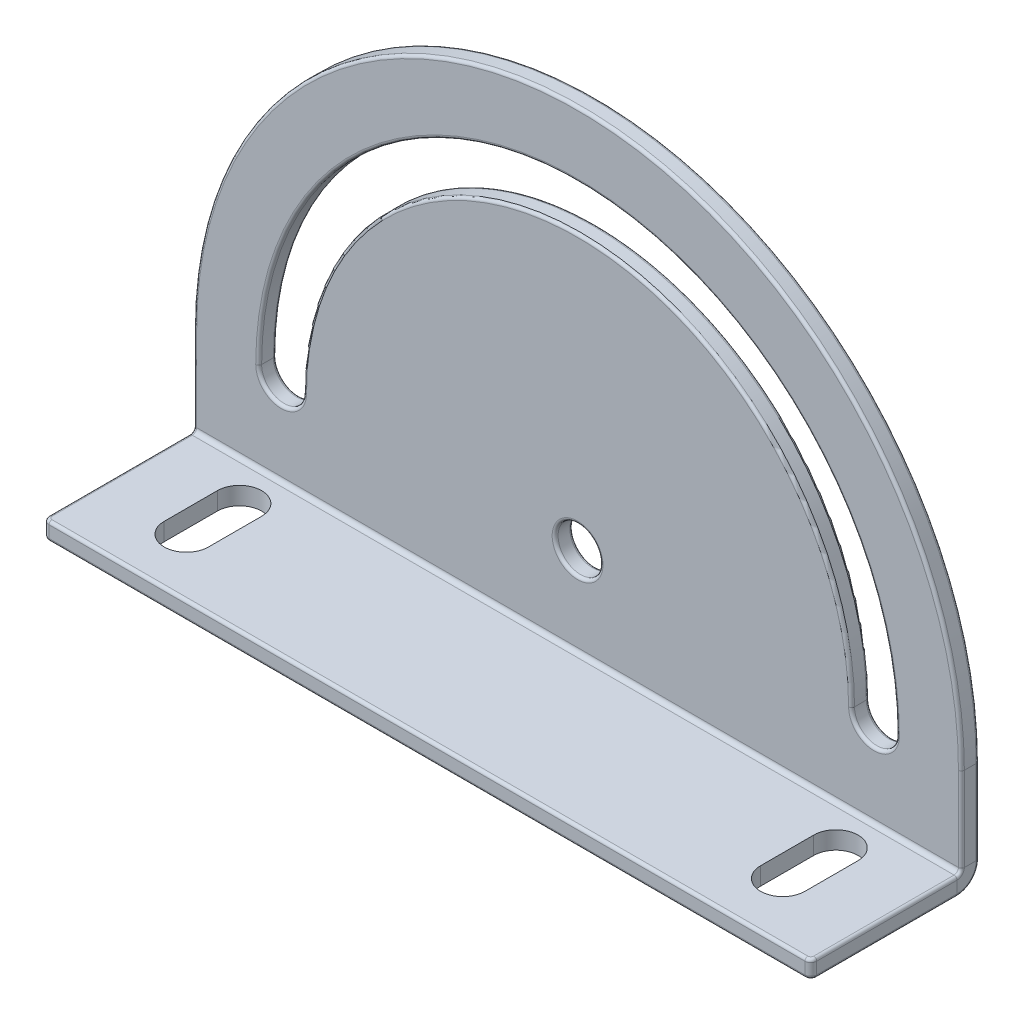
ISO-10303-21;
HEADER;
FILE_DESCRIPTION(('STEP AP214'),'2;1');
FILE_NAME('part.step','',(''),(''),'','','');
FILE_SCHEMA(('AUTOMOTIVE_DESIGN { 1 0 10303 214 1 1 1 1 }'));
ENDSEC;
DATA;
#1=APPLICATION_CONTEXT('core data for automotive mechanical design processes');
#2=APPLICATION_PROTOCOL_DEFINITION('international standard','automotive_design',2000,#1);
#3=PRODUCT_CONTEXT('',#1,'mechanical');
#4=PRODUCT('Part','Part','',(#3));
#5=PRODUCT_RELATED_PRODUCT_CATEGORY('part','',(#4));
#6=PRODUCT_DEFINITION_FORMATION('','',#4);
#7=PRODUCT_DEFINITION_CONTEXT('part definition',#1,'design');
#8=PRODUCT_DEFINITION('design','',#6,#7);
#9=PRODUCT_DEFINITION_SHAPE('','',#8);
#10=(LENGTH_UNIT() NAMED_UNIT(*) SI_UNIT(.MILLI.,.METRE.));
#11=(NAMED_UNIT(*) PLANE_ANGLE_UNIT() SI_UNIT($,.RADIAN.));
#12=(NAMED_UNIT(*) SI_UNIT($,.STERADIAN.) SOLID_ANGLE_UNIT());
#13=UNCERTAINTY_MEASURE_WITH_UNIT(LENGTH_MEASURE(1.E-05),#10,'distance_accuracy_value','');
#14=(GEOMETRIC_REPRESENTATION_CONTEXT(3) GLOBAL_UNCERTAINTY_ASSIGNED_CONTEXT((#13)) GLOBAL_UNIT_ASSIGNED_CONTEXT((#10,
#11,#12)) REPRESENTATION_CONTEXT('',''));
#15=CARTESIAN_POINT('',(0.,0.,0.));
#16=DIRECTION('',(0.,0.,1.));
#17=DIRECTION('',(1.,0.,0.));
#18=AXIS2_PLACEMENT_3D('',#15,#16,#17);
#19=CARTESIAN_POINT('',(65.,0.,-3.));
#20=DIRECTION('',(1.,0.,0.));
#21=DIRECTION('',(0.,0.,-1.));
#22=AXIS2_PLACEMENT_3D('',#19,#20,#21);
#23=PLANE('',#22);
#24=DIRECTION('',(0.,0.,-1.));
#25=VECTOR('',#24,1.);
#26=CARTESIAN_POINT('',(65.,0.736599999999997,0.));
#27=LINE('',#26,#25);
#28=CARTESIAN_POINT('',(65.,0.736599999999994,-0.5));
#29=VERTEX_POINT('',#28);
#30=CARTESIAN_POINT('',(65.,0.736599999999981,-2.5));
#31=VERTEX_POINT('',#30);
#32=EDGE_CURVE('E363',#29,#31,#27,.T.);
#33=ORIENTED_EDGE('',*,*,#32,.T.);
#34=DIRECTION('',(0.,1.,0.));
#35=VECTOR('',#34,1.);
#36=CARTESIAN_POINT('',(65.,15.,-2.5));
#37=LINE('',#36,#35);
#38=CARTESIAN_POINT('',(65.,15.,-2.5));
#39=VERTEX_POINT('',#38);
#40=EDGE_CURVE('E463',#31,#39,#37,.T.);
#41=ORIENTED_EDGE('',*,*,#40,.T.);
#42=DIRECTION('',(0.,0.,1.));
#43=VECTOR('',#42,1.);
#44=CARTESIAN_POINT('',(65.,15.,-3.));
#45=LINE('',#44,#43);
#46=CARTESIAN_POINT('',(65.,15.,-0.5));
#47=VERTEX_POINT('',#46);
#48=EDGE_CURVE('E375',#39,#47,#45,.T.);
#49=ORIENTED_EDGE('',*,*,#48,.T.);
#50=DIRECTION('',(0.,1.,0.));
#51=VECTOR('',#50,1.);
#52=CARTESIAN_POINT('',(65.,0.,-0.5));
#53=LINE('',#52,#51);
#54=EDGE_CURVE('E461',#47,#29,#53,.F.);
#55=ORIENTED_EDGE('',*,*,#54,.T.);
#56=EDGE_LOOP('',(#33,#41,#49,#55));
#57=FACE_BOUND('',#56,.T.);
#58=ADVANCED_FACE('F40',(#57),#23,.T.);
#59=CARTESIAN_POINT('',(0.,15.,-3.));
#60=DIRECTION('',(0.,0.,1.));
#61=DIRECTION('',(1.,0.,0.));
#62=AXIS2_PLACEMENT_3D('',#59,#60,#61);
#63=PLANE('',#62);
#64=CARTESIAN_POINT('',(0.,15.,-3.));
#65=DIRECTION('',(0.,0.,1.));
#66=DIRECTION('',(1.,0.,0.));
#67=AXIS2_PLACEMENT_3D('',#64,#65,#66);
#68=CIRCLE('',#67,45.9);
#69=CARTESIAN_POINT('',(-45.9,15.,-3.));
#70=VERTEX_POINT('',#69);
#71=CARTESIAN_POINT('',(45.9,15.,-3.));
#72=VERTEX_POINT('',#71);
#73=EDGE_CURVE('E472',#70,#72,#68,.F.);
#74=ORIENTED_EDGE('',*,*,#73,.T.);
#75=CARTESIAN_POINT('',(50.2,15.,-3.));
#76=DIRECTION('',(0.,0.,1.));
#77=DIRECTION('',(1.,0.,0.));
#78=AXIS2_PLACEMENT_3D('',#75,#76,#77);
#79=CIRCLE('',#78,4.3);
#80=CARTESIAN_POINT('',(54.5,15.,-3.));
#81=VERTEX_POINT('',#80);
#82=EDGE_CURVE('E474',#72,#81,#79,.T.);
#83=ORIENTED_EDGE('',*,*,#82,.T.);
#84=CARTESIAN_POINT('',(0.,15.,-3.));
#85=DIRECTION('',(0.,0.,1.));
#86=DIRECTION('',(1.,0.,0.));
#87=AXIS2_PLACEMENT_3D('',#84,#85,#86);
#88=CIRCLE('',#87,54.5);
#89=CARTESIAN_POINT('',(-54.5,15.,-3.));
#90=VERTEX_POINT('',#89);
#91=EDGE_CURVE('E468',#81,#90,#88,.T.);
#92=ORIENTED_EDGE('',*,*,#91,.T.);
#93=CARTESIAN_POINT('',(-50.2,15.,-3.));
#94=DIRECTION('',(0.,0.,1.));
#95=DIRECTION('',(1.,0.,0.));
#96=AXIS2_PLACEMENT_3D('',#93,#94,#95);
#97=CIRCLE('',#96,4.30000000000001);
#98=EDGE_CURVE('E470',#90,#70,#97,.T.);
#99=ORIENTED_EDGE('',*,*,#98,.T.);
#100=EDGE_LOOP('',(#74,#83,#92,#99));
#101=FACE_BOUND('',#100,.T.);
#102=CARTESIAN_POINT('',(0.,15.,-3.));
#103=DIRECTION('',(0.,0.,1.));
#104=DIRECTION('',(1.,0.,0.));
#105=AXIS2_PLACEMENT_3D('',#102,#103,#104);
#106=CIRCLE('',#105,4.3);
#107=CARTESIAN_POINT('',(4.3,15.,-3.));
#108=VERTEX_POINT('',#107);
#109=EDGE_CURVE('E465',#108,#108,#106,.T.);
#110=ORIENTED_EDGE('',*,*,#109,.T.);
#111=EDGE_LOOP('',(#110));
#112=FACE_BOUND('',#111,.T.);
#113=CARTESIAN_POINT('',(0.,15.,-3.));
#114=DIRECTION('',(0.,0.,1.));
#115=DIRECTION('',(1.,0.,0.));
#116=AXIS2_PLACEMENT_3D('',#113,#114,#115);
#117=CIRCLE('',#116,64.5);
#118=CARTESIAN_POINT('',(-64.5,15.,-3.));
#119=VERTEX_POINT('',#118);
#120=CARTESIAN_POINT('',(64.5,15.,-3.));
#121=VERTEX_POINT('',#120);
#122=EDGE_CURVE('E479',#119,#121,#117,.F.);
#123=ORIENTED_EDGE('',*,*,#122,.T.);
#124=DIRECTION('',(0.,1.,0.));
#125=VECTOR('',#124,1.);
#126=CARTESIAN_POINT('',(64.5,0.736599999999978,-3.));
#127=LINE('',#126,#125);
#128=CARTESIAN_POINT('',(64.5,0.736599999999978,-3.));
#129=VERTEX_POINT('',#128);
#130=EDGE_CURVE('E481',#121,#129,#127,.F.);
#131=ORIENTED_EDGE('',*,*,#130,.T.);
#132=DIRECTION('',(1.,0.,0.));
#133=VECTOR('',#132,1.);
#134=CARTESIAN_POINT('',(65.,0.736599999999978,-3.));
#135=LINE('',#134,#133);
#136=CARTESIAN_POINT('',(-64.5,0.736599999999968,-3.));
#137=VERTEX_POINT('',#136);
#138=EDGE_CURVE('E360',#129,#137,#135,.F.);
#139=ORIENTED_EDGE('',*,*,#138,.T.);
#140=DIRECTION('',(0.,-1.,0.));
#141=VECTOR('',#140,1.);
#142=CARTESIAN_POINT('',(-64.5,15.,-3.));
#143=LINE('',#142,#141);
#144=EDGE_CURVE('E477',#137,#119,#143,.F.);
#145=ORIENTED_EDGE('',*,*,#144,.T.);
#146=EDGE_LOOP('',(#123,#131,#139,#145));
#147=FACE_BOUND('',#146,.T.);
#148=ADVANCED_FACE('F645',(#101,#112,#147),#63,.F.);
#149=CARTESIAN_POINT('',(0.,15.,0.));
#150=DIRECTION('',(0.,0.,1.));
#151=DIRECTION('',(1.,0.,0.));
#152=AXIS2_PLACEMENT_3D('',#149,#150,#151);
#153=PLANE('',#152);
#154=CARTESIAN_POINT('',(50.2,15.,0.));
#155=DIRECTION('',(0.,0.,1.));
#156=DIRECTION('',(1.,0.,0.));
#157=AXIS2_PLACEMENT_3D('',#154,#155,#156);
#158=CIRCLE('',#157,4.3);
#159=CARTESIAN_POINT('',(54.5,15.,0.));
#160=VERTEX_POINT('',#159);
#161=CARTESIAN_POINT('',(45.9,15.,0.));
#162=VERTEX_POINT('',#161);
#163=EDGE_CURVE('E522',#160,#162,#158,.F.);
#164=ORIENTED_EDGE('',*,*,#163,.T.);
#165=CARTESIAN_POINT('',(0.,15.,0.));
#166=DIRECTION('',(0.,0.,1.));
#167=DIRECTION('',(1.,0.,0.));
#168=AXIS2_PLACEMENT_3D('',#165,#166,#167);
#169=CIRCLE('',#168,45.9);
#170=CARTESIAN_POINT('',(-45.9,15.,0.));
#171=VERTEX_POINT('',#170);
#172=EDGE_CURVE('E524',#162,#171,#169,.T.);
#173=ORIENTED_EDGE('',*,*,#172,.T.);
#174=CARTESIAN_POINT('',(-50.2,15.,0.));
#175=DIRECTION('',(0.,0.,1.));
#176=DIRECTION('',(1.,0.,0.));
#177=AXIS2_PLACEMENT_3D('',#174,#175,#176);
#178=CIRCLE('',#177,4.30000000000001);
#179=CARTESIAN_POINT('',(-54.5,15.,0.));
#180=VERTEX_POINT('',#179);
#181=EDGE_CURVE('E518',#171,#180,#178,.F.);
#182=ORIENTED_EDGE('',*,*,#181,.T.);
#183=CARTESIAN_POINT('',(0.,15.,0.));
#184=DIRECTION('',(0.,0.,1.));
#185=DIRECTION('',(1.,0.,0.));
#186=AXIS2_PLACEMENT_3D('',#183,#184,#185);
#187=CIRCLE('',#186,54.5);
#188=EDGE_CURVE('E520',#180,#160,#187,.F.);
#189=ORIENTED_EDGE('',*,*,#188,.T.);
#190=EDGE_LOOP('',(#164,#173,#182,#189));
#191=FACE_BOUND('',#190,.T.);
#192=CARTESIAN_POINT('',(0.,15.,0.));
#193=DIRECTION('',(0.,0.,1.));
#194=DIRECTION('',(1.,0.,0.));
#195=AXIS2_PLACEMENT_3D('',#192,#193,#194);
#196=CIRCLE('',#195,4.3);
#197=CARTESIAN_POINT('',(4.3,15.,0.));
#198=VERTEX_POINT('',#197);
#199=EDGE_CURVE('E515',#198,#198,#196,.F.);
#200=ORIENTED_EDGE('',*,*,#199,.T.);
#201=EDGE_LOOP('',(#200));
#202=FACE_BOUND('',#201,.T.);
#203=DIRECTION('',(1.,0.,0.));
#204=VECTOR('',#203,1.);
#205=CARTESIAN_POINT('',(65.,0.736599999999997,0.));
#206=LINE('',#205,#204);
#207=CARTESIAN_POINT('',(64.5,0.736599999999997,0.));
#208=VERTEX_POINT('',#207);
#209=CARTESIAN_POINT('',(-64.5,0.736599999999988,0.));
#210=VERTEX_POINT('',#209);
#211=EDGE_CURVE('E359',#208,#210,#206,.F.);
#212=ORIENTED_EDGE('',*,*,#211,.F.);
#213=DIRECTION('',(0.,1.,0.));
#214=VECTOR('',#213,1.);
#215=CARTESIAN_POINT('',(64.5,15.,0.));
#216=LINE('',#215,#214);
#217=CARTESIAN_POINT('',(64.5,15.,0.));
#218=VERTEX_POINT('',#217);
#219=EDGE_CURVE('E11',#208,#218,#216,.T.);
#220=ORIENTED_EDGE('',*,*,#219,.T.);
#221=CARTESIAN_POINT('',(0.,15.,0.));
#222=DIRECTION('',(0.,0.,1.));
#223=DIRECTION('',(1.,0.,0.));
#224=AXIS2_PLACEMENT_3D('',#221,#222,#223);
#225=CIRCLE('',#224,64.5);
#226=CARTESIAN_POINT('',(-64.5,15.,0.));
#227=VERTEX_POINT('',#226);
#228=EDGE_CURVE('E49',#218,#227,#225,.T.);
#229=ORIENTED_EDGE('',*,*,#228,.T.);
#230=DIRECTION('',(0.,-1.,0.));
#231=VECTOR('',#230,1.);
#232=CARTESIAN_POINT('',(-64.5,15.,0.));
#233=LINE('',#232,#231);
#234=EDGE_CURVE('E527',#227,#210,#233,.T.);
#235=ORIENTED_EDGE('',*,*,#234,.T.);
#236=EDGE_LOOP('',(#212,#220,#229,#235));
#237=FACE_BOUND('',#236,.T.);
#238=ADVANCED_FACE('F616',(#191,#202,#237),#153,.T.);
#239=CARTESIAN_POINT('',(-65.,0.,-3.));
#240=DIRECTION('',(-1.,0.,0.));
#241=DIRECTION('',(0.,0.,1.));
#242=AXIS2_PLACEMENT_3D('',#239,#240,#241);
#243=PLANE('',#242);
#244=DIRECTION('',(0.,0.,1.));
#245=VECTOR('',#244,1.);
#246=CARTESIAN_POINT('',(-65.,15.,-3.));
#247=LINE('',#246,#245);
#248=CARTESIAN_POINT('',(-65.,15.,-2.5));
#249=VERTEX_POINT('',#248);
#250=CARTESIAN_POINT('',(-65.,15.,-0.5));
#251=VERTEX_POINT('',#250);
#252=EDGE_CURVE('E384',#249,#251,#247,.T.);
#253=ORIENTED_EDGE('',*,*,#252,.F.);
#254=DIRECTION('',(0.,-1.,0.));
#255=VECTOR('',#254,1.);
#256=CARTESIAN_POINT('',(-65.,0.736600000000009,-2.5));
#257=LINE('',#256,#255);
#258=CARTESIAN_POINT('',(-65.,0.736599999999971,-2.5));
#259=VERTEX_POINT('',#258);
#260=EDGE_CURVE('E489',#249,#259,#257,.T.);
#261=ORIENTED_EDGE('',*,*,#260,.T.);
#262=DIRECTION('',(0.,0.,-1.));
#263=VECTOR('',#262,1.);
#264=CARTESIAN_POINT('',(-65.,0.736599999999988,0.));
#265=LINE('',#264,#263);
#266=CARTESIAN_POINT('',(-65.,0.736599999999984,-0.5));
#267=VERTEX_POINT('',#266);
#268=EDGE_CURVE('E366',#267,#259,#265,.T.);
#269=ORIENTED_EDGE('',*,*,#268,.F.);
#270=DIRECTION('',(0.,-1.,0.));
#271=VECTOR('',#270,1.);
#272=CARTESIAN_POINT('',(-65.,0.,-0.5));
#273=LINE('',#272,#271);
#274=EDGE_CURVE('E487',#267,#251,#273,.F.);
#275=ORIENTED_EDGE('',*,*,#274,.T.);
#276=EDGE_LOOP('',(#253,#261,#269,#275));
#277=FACE_BOUND('',#276,.T.);
#278=ADVANCED_FACE('F680',(#277),#243,.T.);
#279=CARTESIAN_POINT('',(0.,15.,-3.));
#280=DIRECTION('',(0.,0.,1.));
#281=DIRECTION('',(1.,0.,0.));
#282=AXIS2_PLACEMENT_3D('',#279,#280,#281);
#283=CYLINDRICAL_SURFACE('',#282,65.);
#284=ORIENTED_EDGE('',*,*,#48,.F.);
#285=CARTESIAN_POINT('',(0.,15.,-2.5));
#286=DIRECTION('',(0.,0.,1.));
#287=DIRECTION('',(1.,0.,0.));
#288=AXIS2_PLACEMENT_3D('',#285,#286,#287);
#289=CIRCLE('',#288,65.);
#290=EDGE_CURVE('E485',#39,#249,#289,.T.);
#291=ORIENTED_EDGE('',*,*,#290,.T.);
#292=ORIENTED_EDGE('',*,*,#252,.T.);
#293=CARTESIAN_POINT('',(0.,15.,-0.5));
#294=DIRECTION('',(0.,0.,1.));
#295=DIRECTION('',(1.,0.,0.));
#296=AXIS2_PLACEMENT_3D('',#293,#294,#295);
#297=CIRCLE('',#296,65.);
#298=EDGE_CURVE('E483',#251,#47,#297,.F.);
#299=ORIENTED_EDGE('',*,*,#298,.T.);
#300=EDGE_LOOP('',(#284,#291,#292,#299));
#301=FACE_BOUND('',#300,.T.);
#302=ADVANCED_FACE('F678',(#301),#283,.T.);
#303=CARTESIAN_POINT('',(0.,15.,-3.));
#304=DIRECTION('',(0.,0.,1.));
#305=DIRECTION('',(1.,0.,0.));
#306=AXIS2_PLACEMENT_3D('',#303,#304,#305);
#307=CYLINDRICAL_SURFACE('',#306,3.8);
#308=CARTESIAN_POINT('',(0.,15.,-2.5));
#309=DIRECTION('',(0.,0.,1.));
#310=DIRECTION('',(1.,0.,0.));
#311=AXIS2_PLACEMENT_3D('',#308,#309,#310);
#312=CIRCLE('',#311,3.8);
#313=CARTESIAN_POINT('',(3.8,15.,-2.5));
#314=VERTEX_POINT('',#313);
#315=EDGE_CURVE('E512',#314,#314,#312,.F.);
#316=ORIENTED_EDGE('',*,*,#315,.T.);
#317=EDGE_LOOP('',(#316));
#318=FACE_BOUND('',#317,.T.);
#319=CARTESIAN_POINT('',(0.,15.,-0.5));
#320=DIRECTION('',(0.,0.,1.));
#321=DIRECTION('',(1.,0.,0.));
#322=AXIS2_PLACEMENT_3D('',#319,#320,#321);
#323=CIRCLE('',#322,3.8);
#324=CARTESIAN_POINT('',(3.8,15.,-0.5));
#325=VERTEX_POINT('',#324);
#326=EDGE_CURVE('E509',#325,#325,#323,.T.);
#327=ORIENTED_EDGE('',*,*,#326,.T.);
#328=EDGE_LOOP('',(#327));
#329=FACE_BOUND('',#328,.T.);
#330=ADVANCED_FACE('F1193',(#318,#329),#307,.F.);
#331=CARTESIAN_POINT('',(-50.2,15.,-3.));
#332=DIRECTION('',(0.,0.,1.));
#333=DIRECTION('',(1.,0.,0.));
#334=AXIS2_PLACEMENT_3D('',#331,#332,#333);
#335=CYLINDRICAL_SURFACE('',#334,3.8);
#336=DIRECTION('',(0.,0.,1.));
#337=VECTOR('',#336,1.);
#338=CARTESIAN_POINT('',(-46.4,15.,-3.));
#339=LINE('',#338,#337);
#340=CARTESIAN_POINT('',(-46.4,15.,-2.5));
#341=VERTEX_POINT('',#340);
#342=CARTESIAN_POINT('',(-46.4,15.,-0.5));
#343=VERTEX_POINT('',#342);
#344=EDGE_CURVE('E369',#341,#343,#339,.T.);
#345=ORIENTED_EDGE('',*,*,#344,.F.);
#346=CARTESIAN_POINT('',(-50.2,15.,-2.5));
#347=DIRECTION('',(0.,0.,1.));
#348=DIRECTION('',(1.,0.,0.));
#349=AXIS2_PLACEMENT_3D('',#346,#347,#348);
#350=CIRCLE('',#349,3.8);
#351=CARTESIAN_POINT('',(-54.,15.,-2.5));
#352=VERTEX_POINT('',#351);
#353=EDGE_CURVE('E503',#341,#352,#350,.F.);
#354=ORIENTED_EDGE('',*,*,#353,.T.);
#355=DIRECTION('',(0.,0.,1.));
#356=VECTOR('',#355,1.);
#357=CARTESIAN_POINT('',(-54.,15.,-3.));
#358=LINE('',#357,#356);
#359=CARTESIAN_POINT('',(-54.,15.,-0.5));
#360=VERTEX_POINT('',#359);
#361=EDGE_CURVE('E372',#352,#360,#358,.T.);
#362=ORIENTED_EDGE('',*,*,#361,.T.);
#363=CARTESIAN_POINT('',(-50.2,15.,-0.5));
#364=DIRECTION('',(0.,0.,1.));
#365=DIRECTION('',(1.,0.,0.));
#366=AXIS2_PLACEMENT_3D('',#363,#364,#365);
#367=CIRCLE('',#366,3.8);
#368=EDGE_CURVE('E501',#360,#343,#367,.T.);
#369=ORIENTED_EDGE('',*,*,#368,.T.);
#370=EDGE_LOOP('',(#345,#354,#362,#369));
#371=FACE_BOUND('',#370,.T.);
#372=ADVANCED_FACE('F653',(#371),#335,.F.);
#373=CARTESIAN_POINT('',(0.,15.,-3.));
#374=DIRECTION('',(0.,0.,1.));
#375=DIRECTION('',(1.,0.,0.));
#376=AXIS2_PLACEMENT_3D('',#373,#374,#375);
#377=CYLINDRICAL_SURFACE('',#376,54.);
#378=ORIENTED_EDGE('',*,*,#361,.F.);
#379=CARTESIAN_POINT('',(0.,15.,-2.5));
#380=DIRECTION('',(0.,0.,1.));
#381=DIRECTION('',(1.,0.,0.));
#382=AXIS2_PLACEMENT_3D('',#379,#380,#381);
#383=CIRCLE('',#382,54.);
#384=CARTESIAN_POINT('',(54.,15.,-2.5));
#385=VERTEX_POINT('',#384);
#386=EDGE_CURVE('E507',#352,#385,#383,.F.);
#387=ORIENTED_EDGE('',*,*,#386,.T.);
#388=DIRECTION('',(0.,0.,1.));
#389=VECTOR('',#388,1.);
#390=CARTESIAN_POINT('',(54.,15.,-3.));
#391=LINE('',#390,#389);
#392=CARTESIAN_POINT('',(54.,15.,-0.5));
#393=VERTEX_POINT('',#392);
#394=EDGE_CURVE('E376',#385,#393,#391,.T.);
#395=ORIENTED_EDGE('',*,*,#394,.T.);
#396=CARTESIAN_POINT('',(0.,15.,-0.5));
#397=DIRECTION('',(0.,0.,1.));
#398=DIRECTION('',(1.,0.,0.));
#399=AXIS2_PLACEMENT_3D('',#396,#397,#398);
#400=CIRCLE('',#399,54.);
#401=EDGE_CURVE('E505',#393,#360,#400,.T.);
#402=ORIENTED_EDGE('',*,*,#401,.T.);
#403=EDGE_LOOP('',(#378,#387,#395,#402));
#404=FACE_BOUND('',#403,.T.);
#405=ADVANCED_FACE('F1173',(#404),#377,.F.);
#406=CARTESIAN_POINT('',(50.2,15.,-3.));
#407=DIRECTION('',(0.,0.,1.));
#408=DIRECTION('',(1.,0.,0.));
#409=AXIS2_PLACEMENT_3D('',#406,#407,#408);
#410=CYLINDRICAL_SURFACE('',#409,3.8);
#411=ORIENTED_EDGE('',*,*,#394,.F.);
#412=CARTESIAN_POINT('',(50.2,15.,-2.5));
#413=DIRECTION('',(0.,0.,1.));
#414=DIRECTION('',(1.,0.,0.));
#415=AXIS2_PLACEMENT_3D('',#412,#413,#414);
#416=CIRCLE('',#415,3.8);
#417=CARTESIAN_POINT('',(46.4,15.,-2.5));
#418=VERTEX_POINT('',#417);
#419=EDGE_CURVE('E493',#385,#418,#416,.F.);
#420=ORIENTED_EDGE('',*,*,#419,.T.);
#421=DIRECTION('',(0.,0.,1.));
#422=VECTOR('',#421,1.);
#423=CARTESIAN_POINT('',(46.4,15.,-3.));
#424=LINE('',#423,#422);
#425=CARTESIAN_POINT('',(46.4,15.,-0.5));
#426=VERTEX_POINT('',#425);
#427=EDGE_CURVE('E379',#418,#426,#424,.T.);
#428=ORIENTED_EDGE('',*,*,#427,.T.);
#429=CARTESIAN_POINT('',(50.2,15.,-0.5));
#430=DIRECTION('',(0.,0.,1.));
#431=DIRECTION('',(1.,0.,0.));
#432=AXIS2_PLACEMENT_3D('',#429,#430,#431);
#433=CIRCLE('',#432,3.8);
#434=EDGE_CURVE('E491',#426,#393,#433,.T.);
#435=ORIENTED_EDGE('',*,*,#434,.T.);
#436=EDGE_LOOP('',(#411,#420,#428,#435));
#437=FACE_BOUND('',#436,.T.);
#438=ADVANCED_FACE('F630',(#437),#410,.F.);
#439=CARTESIAN_POINT('',(0.,15.,-3.));
#440=DIRECTION('',(0.,0.,1.));
#441=DIRECTION('',(1.,0.,0.));
#442=AXIS2_PLACEMENT_3D('',#439,#440,#441);
#443=CYLINDRICAL_SURFACE('',#442,46.4);
#444=ORIENTED_EDGE('',*,*,#427,.F.);
#445=CARTESIAN_POINT('',(0.,15.,-2.5));
#446=DIRECTION('',(0.,0.,1.));
#447=DIRECTION('',(1.,0.,0.));
#448=AXIS2_PLACEMENT_3D('',#445,#446,#447);
#449=CIRCLE('',#448,46.4);
#450=EDGE_CURVE('E499',#418,#341,#449,.T.);
#451=ORIENTED_EDGE('',*,*,#450,.T.);
#452=ORIENTED_EDGE('',*,*,#344,.T.);
#453=CARTESIAN_POINT('',(0.,15.,-0.5));
#454=DIRECTION('',(0.,0.,1.));
#455=DIRECTION('',(1.,0.,0.));
#456=AXIS2_PLACEMENT_3D('',#453,#454,#455);
#457=CIRCLE('',#456,46.4);
#458=EDGE_CURVE('E496',#343,#426,#457,.F.);
#459=ORIENTED_EDGE('',*,*,#458,.T.);
#460=EDGE_LOOP('',(#444,#451,#452,#459));
#461=FACE_BOUND('',#460,.T.);
#462=ADVANCED_FACE('F628',(#461),#443,.T.);
#463=CARTESIAN_POINT('',(-65.,0.736599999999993,0.7366));
#464=DIRECTION('',(-1.,0.,0.));
#465=DIRECTION('',(0.,-1.,0.));
#466=AXIS2_PLACEMENT_3D('',#463,#464,#465);
#467=PLANE('',#466);
#468=ORIENTED_EDGE('',*,*,#268,.T.);
#469=CARTESIAN_POINT('',(-65.,0.736599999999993,0.7366));
#470=DIRECTION('',(-1.,0.,0.));
#471=DIRECTION('',(0.,-1.,0.));
#472=AXIS2_PLACEMENT_3D('',#469,#470,#471);
#473=CIRCLE('',#472,3.2366);
#474=CARTESIAN_POINT('',(-65.,-2.5,0.736599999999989));
#475=VERTEX_POINT('',#474);
#476=EDGE_CURVE('E444',#259,#475,#473,.T.);
#477=ORIENTED_EDGE('',*,*,#476,.T.);
#478=DIRECTION('',(0.,-1.,0.));
#479=VECTOR('',#478,1.);
#480=CARTESIAN_POINT('',(-65.,0.,0.736599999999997));
#481=LINE('',#480,#479);
#482=CARTESIAN_POINT('',(-65.,-0.500000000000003,0.736599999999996));
#483=VERTEX_POINT('',#482);
#484=EDGE_CURVE('E341',#483,#475,#481,.T.);
#485=ORIENTED_EDGE('',*,*,#484,.F.);
#486=CARTESIAN_POINT('',(-65.,0.736599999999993,0.7366));
#487=DIRECTION('',(-1.,0.,0.));
#488=DIRECTION('',(0.,-1.,0.));
#489=AXIS2_PLACEMENT_3D('',#486,#487,#488);
#490=CIRCLE('',#489,1.2366);
#491=EDGE_CURVE('E442',#483,#267,#490,.F.);
#492=ORIENTED_EDGE('',*,*,#491,.T.);
#493=EDGE_LOOP('',(#468,#477,#485,#492));
#494=FACE_BOUND('',#493,.T.);
#495=ADVANCED_FACE('F1125',(#494),#467,.T.);
#496=CARTESIAN_POINT('',(65.,0.736600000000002,0.7366));
#497=DIRECTION('',(-1.,0.,0.));
#498=DIRECTION('',(0.,-1.,0.));
#499=AXIS2_PLACEMENT_3D('',#496,#497,#498);
#500=PLANE('',#499);
#501=DIRECTION('',(0.,-1.,0.));
#502=VECTOR('',#501,1.);
#503=CARTESIAN_POINT('',(65.,0.,0.736599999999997));
#504=LINE('',#503,#502);
#505=CARTESIAN_POINT('',(65.,-0.500000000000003,0.736599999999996));
#506=VERTEX_POINT('',#505);
#507=CARTESIAN_POINT('',(65.,-2.5,0.736599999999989));
#508=VERTEX_POINT('',#507);
#509=EDGE_CURVE('E351',#506,#508,#504,.T.);
#510=ORIENTED_EDGE('',*,*,#509,.T.);
#511=CARTESIAN_POINT('',(65.,0.736600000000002,0.7366));
#512=DIRECTION('',(-1.,0.,0.));
#513=DIRECTION('',(0.,-1.,0.));
#514=AXIS2_PLACEMENT_3D('',#511,#512,#513);
#515=CIRCLE('',#514,3.2366);
#516=EDGE_CURVE('E404',#508,#31,#515,.F.);
#517=ORIENTED_EDGE('',*,*,#516,.T.);
#518=ORIENTED_EDGE('',*,*,#32,.F.);
#519=CARTESIAN_POINT('',(65.,0.736600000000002,0.7366));
#520=DIRECTION('',(-1.,0.,0.));
#521=DIRECTION('',(0.,-1.,0.));
#522=AXIS2_PLACEMENT_3D('',#519,#520,#521);
#523=CIRCLE('',#522,1.2366);
#524=EDGE_CURVE('E401',#29,#506,#523,.T.);
#525=ORIENTED_EDGE('',*,*,#524,.T.);
#526=EDGE_LOOP('',(#510,#517,#518,#525));
#527=FACE_BOUND('',#526,.T.);
#528=ADVANCED_FACE('F1114',(#527),#500,.F.);
#529=CARTESIAN_POINT('',(65.,0.736600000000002,0.7366));
#530=DIRECTION('',(1.,0.,0.));
#531=DIRECTION('',(0.,-1.,0.));
#532=AXIS2_PLACEMENT_3D('',#529,#530,#531);
#533=CYLINDRICAL_SURFACE('',#532,3.7366);
#534=ORIENTED_EDGE('',*,*,#138,.F.);
#535=CARTESIAN_POINT('',(64.5,0.736600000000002,0.7366));
#536=DIRECTION('',(-1.,0.,0.));
#537=DIRECTION('',(0.,-1.,0.));
#538=AXIS2_PLACEMENT_3D('',#535,#536,#537);
#539=CIRCLE('',#538,3.7366);
#540=CARTESIAN_POINT('',(64.5,-3.,0.736599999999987));
#541=VERTEX_POINT('',#540);
#542=EDGE_CURVE('E409',#129,#541,#539,.T.);
#543=ORIENTED_EDGE('',*,*,#542,.T.);
#544=DIRECTION('',(1.,0.,0.));
#545=VECTOR('',#544,1.);
#546=CARTESIAN_POINT('',(0.,-3.,0.736599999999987));
#547=LINE('',#546,#545);
#548=CARTESIAN_POINT('',(-64.5,-3.,0.736599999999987));
#549=VERTEX_POINT('',#548);
#550=EDGE_CURVE('E354',#549,#541,#547,.T.);
#551=ORIENTED_EDGE('',*,*,#550,.F.);
#552=CARTESIAN_POINT('',(-64.5,0.736599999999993,0.7366));
#553=DIRECTION('',(-1.,0.,0.));
#554=DIRECTION('',(0.,-1.,0.));
#555=AXIS2_PLACEMENT_3D('',#552,#553,#554);
#556=CIRCLE('',#555,3.7366);
#557=EDGE_CURVE('E407',#549,#137,#556,.F.);
#558=ORIENTED_EDGE('',*,*,#557,.T.);
#559=EDGE_LOOP('',(#534,#543,#551,#558));
#560=FACE_BOUND('',#559,.T.);
#561=ADVANCED_FACE('F1103',(#560),#533,.T.);
#562=CARTESIAN_POINT('',(65.,0.736600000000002,0.7366));
#563=DIRECTION('',(1.,0.,0.));
#564=DIRECTION('',(0.,-1.,0.));
#565=AXIS2_PLACEMENT_3D('',#562,#563,#564);
#566=CYLINDRICAL_SURFACE('',#565,0.736599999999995);
#567=DIRECTION('',(1.,0.,0.));
#568=VECTOR('',#567,1.);
#569=CARTESIAN_POINT('',(-65.,0.,0.736599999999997));
#570=LINE('',#569,#568);
#571=CARTESIAN_POINT('',(-64.5,0.,0.736599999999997));
#572=VERTEX_POINT('',#571);
#573=CARTESIAN_POINT('',(64.5,0.,0.736599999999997));
#574=VERTEX_POINT('',#573);
#575=EDGE_CURVE('E348',#572,#574,#570,.T.);
#576=ORIENTED_EDGE('',*,*,#575,.T.);
#577=CARTESIAN_POINT('',(64.5,0.736600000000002,0.7366));
#578=DIRECTION('',(-1.,0.,0.));
#579=DIRECTION('',(0.,-1.,0.));
#580=AXIS2_PLACEMENT_3D('',#577,#578,#579);
#581=CIRCLE('',#580,0.736599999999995);
#582=EDGE_CURVE('E448',#574,#208,#581,.F.);
#583=ORIENTED_EDGE('',*,*,#582,.T.);
#584=ORIENTED_EDGE('',*,*,#211,.T.);
#585=CARTESIAN_POINT('',(-64.5,0.736599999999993,0.7366));
#586=DIRECTION('',(-1.,0.,0.));
#587=DIRECTION('',(0.,-1.,0.));
#588=AXIS2_PLACEMENT_3D('',#585,#586,#587);
#589=CIRCLE('',#588,0.736599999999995);
#590=EDGE_CURVE('E446',#210,#572,#589,.T.);
#591=ORIENTED_EDGE('',*,*,#590,.T.);
#592=EDGE_LOOP('',(#576,#583,#584,#591));
#593=FACE_BOUND('',#592,.T.);
#594=ADVANCED_FACE('F1092',(#593),#566,.F.);
#595=CARTESIAN_POINT('',(65.,-3.,0.));
#596=DIRECTION('',(1.,0.,0.));
#597=DIRECTION('',(0.,0.,-1.));
#598=AXIS2_PLACEMENT_3D('',#595,#596,#597);
#599=PLANE('',#598);
#600=DIRECTION('',(0.,1.,0.));
#601=VECTOR('',#600,1.);
#602=CARTESIAN_POINT('',(65.,-3.00000000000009,24.5));
#603=LINE('',#602,#601);
#604=CARTESIAN_POINT('',(65.,-0.500000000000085,24.5));
#605=VERTEX_POINT('',#604);
#606=CARTESIAN_POINT('',(65.,-2.50000000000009,24.5));
#607=VERTEX_POINT('',#606);
#608=EDGE_CURVE('E395',#605,#607,#603,.F.);
#609=ORIENTED_EDGE('',*,*,#608,.T.);
#610=DIRECTION('',(0.,0.,-1.));
#611=VECTOR('',#610,1.);
#612=CARTESIAN_POINT('',(65.,-2.5,0.));
#613=LINE('',#612,#611);
#614=EDGE_CURVE('E414',#607,#508,#613,.T.);
#615=ORIENTED_EDGE('',*,*,#614,.T.);
#616=ORIENTED_EDGE('',*,*,#509,.F.);
#617=DIRECTION('',(0.,0.,-1.));
#618=VECTOR('',#617,1.);
#619=CARTESIAN_POINT('',(65.,-0.500000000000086,24.5));
#620=LINE('',#619,#618);
#621=EDGE_CURVE('E412',#506,#605,#620,.F.);
#622=ORIENTED_EDGE('',*,*,#621,.T.);
#623=EDGE_LOOP('',(#609,#615,#616,#622));
#624=FACE_BOUND('',#623,.T.);
#625=ADVANCED_FACE('F1081',(#624),#599,.T.);
#626=CARTESIAN_POINT('',(-65.,-3.00000000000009,25.5));
#627=DIRECTION('',(-1.,0.,0.));
#628=DIRECTION('',(0.,0.,1.));
#629=AXIS2_PLACEMENT_3D('',#626,#627,#628);
#630=PLANE('',#629);
#631=ORIENTED_EDGE('',*,*,#484,.T.);
#632=DIRECTION('',(0.,0.,1.));
#633=VECTOR('',#632,1.);
#634=CARTESIAN_POINT('',(-65.,-2.50000000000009,25.5));
#635=LINE('',#634,#633);
#636=CARTESIAN_POINT('',(-65.,-2.50000000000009,24.5));
#637=VERTEX_POINT('',#636);
#638=EDGE_CURVE('E440',#475,#637,#635,.T.);
#639=ORIENTED_EDGE('',*,*,#638,.T.);
#640=DIRECTION('',(0.,1.,0.));
#641=VECTOR('',#640,1.);
#642=CARTESIAN_POINT('',(-65.,-3.00000000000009,24.5));
#643=LINE('',#642,#641);
#644=CARTESIAN_POINT('',(-65.,-0.500000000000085,24.5));
#645=VERTEX_POINT('',#644);
#646=EDGE_CURVE('E398',#637,#645,#643,.T.);
#647=ORIENTED_EDGE('',*,*,#646,.T.);
#648=DIRECTION('',(0.,0.,1.));
#649=VECTOR('',#648,1.);
#650=CARTESIAN_POINT('',(-65.,-0.500000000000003,0.736599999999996));
#651=LINE('',#650,#649);
#652=EDGE_CURVE('E438',#645,#483,#651,.F.);
#653=ORIENTED_EDGE('',*,*,#652,.T.);
#654=EDGE_LOOP('',(#631,#639,#647,#653));
#655=FACE_BOUND('',#654,.T.);
#656=ADVANCED_FACE('F1070',(#655),#630,.T.);
#657=CARTESIAN_POINT('',(0.,-3.,0.));
#658=DIRECTION('',(0.,-1.,0.));
#659=DIRECTION('',(0.,0.,-1.));
#660=AXIS2_PLACEMENT_3D('',#657,#658,#659);
#661=PLANE('',#660);
#662=CARTESIAN_POINT('',(50.5,-3.00000000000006,15.75));
#663=DIRECTION('',(0.,-1.,0.));
#664=DIRECTION('',(0.,0.,1.));
#665=AXIS2_PLACEMENT_3D('',#662,#663,#664);
#666=CIRCLE('',#665,3.75603681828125);
#667=CARTESIAN_POINT('',(54.2560368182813,-3.00000000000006,15.75));
#668=VERTEX_POINT('',#667);
#669=CARTESIAN_POINT('',(46.7439631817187,-3.00000000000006,15.75));
#670=VERTEX_POINT('',#669);
#671=EDGE_CURVE('E278',#668,#670,#666,.T.);
#672=ORIENTED_EDGE('',*,*,#671,.F.);
#673=DIRECTION('',(0.,0.,1.));
#674=VECTOR('',#673,1.);
#675=CARTESIAN_POINT('',(54.2560368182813,-3.00000000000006,15.75));
#676=LINE('',#675,#674);
#677=CARTESIAN_POINT('',(54.2560368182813,-3.00000000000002,6.74999999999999));
#678=VERTEX_POINT('',#677);
#679=EDGE_CURVE('E296',#678,#668,#676,.T.);
#680=ORIENTED_EDGE('',*,*,#679,.F.);
#681=CARTESIAN_POINT('',(50.5,-3.00000000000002,6.74999999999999));
#682=DIRECTION('',(0.,-1.,0.));
#683=DIRECTION('',(0.,0.,1.));
#684=AXIS2_PLACEMENT_3D('',#681,#682,#683);
#685=CIRCLE('',#684,3.75603681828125);
#686=CARTESIAN_POINT('',(46.7439631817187,-3.00000000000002,6.74999999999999));
#687=VERTEX_POINT('',#686);
#688=EDGE_CURVE('E299',#687,#678,#685,.T.);
#689=ORIENTED_EDGE('',*,*,#688,.F.);
#690=DIRECTION('',(0.,0.,-1.));
#691=VECTOR('',#690,1.);
#692=CARTESIAN_POINT('',(46.7439631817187,-3.00000000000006,15.75));
#693=LINE('',#692,#691);
#694=EDGE_CURVE('E305',#670,#687,#693,.T.);
#695=ORIENTED_EDGE('',*,*,#694,.F.);
#696=EDGE_LOOP('',(#672,#680,#689,#695));
#697=FACE_BOUND('',#696,.T.);
#698=CARTESIAN_POINT('',(-50.5,-3.00000000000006,15.75));
#699=DIRECTION('',(0.,-1.,0.));
#700=DIRECTION('',(0.,0.,-1.));
#701=AXIS2_PLACEMENT_3D('',#698,#699,#700);
#702=CIRCLE('',#701,3.75603681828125);
#703=CARTESIAN_POINT('',(-46.7439631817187,-3.00000000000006,15.75));
#704=VERTEX_POINT('',#703);
#705=CARTESIAN_POINT('',(-54.2560368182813,-3.00000000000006,15.75));
#706=VERTEX_POINT('',#705);
#707=EDGE_CURVE('E312',#704,#706,#702,.T.);
#708=ORIENTED_EDGE('',*,*,#707,.F.);
#709=DIRECTION('',(0.,0.,1.));
#710=VECTOR('',#709,1.);
#711=CARTESIAN_POINT('',(-46.7439631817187,-3.00000000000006,15.75));
#712=LINE('',#711,#710);
#713=CARTESIAN_POINT('',(-46.7439631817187,-3.00000000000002,6.74999999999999));
#714=VERTEX_POINT('',#713);
#715=EDGE_CURVE('E320',#714,#704,#712,.T.);
#716=ORIENTED_EDGE('',*,*,#715,.F.);
#717=CARTESIAN_POINT('',(-50.5,-3.00000000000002,6.74999999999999));
#718=DIRECTION('',(0.,-1.,0.));
#719=DIRECTION('',(0.,0.,-1.));
#720=AXIS2_PLACEMENT_3D('',#717,#718,#719);
#721=CIRCLE('',#720,3.75603681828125);
#722=CARTESIAN_POINT('',(-54.2560368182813,-3.00000000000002,6.74999999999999));
#723=VERTEX_POINT('',#722);
#724=EDGE_CURVE('E334',#723,#714,#721,.T.);
#725=ORIENTED_EDGE('',*,*,#724,.F.);
#726=DIRECTION('',(0.,0.,-1.));
#727=VECTOR('',#726,1.);
#728=CARTESIAN_POINT('',(-54.2560368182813,-3.00000000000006,15.75));
#729=LINE('',#728,#727);
#730=EDGE_CURVE('E331',#706,#723,#729,.T.);
#731=ORIENTED_EDGE('',*,*,#730,.F.);
#732=EDGE_LOOP('',(#708,#716,#725,#731));
#733=FACE_BOUND('',#732,.T.);
#734=ORIENTED_EDGE('',*,*,#550,.T.);
#735=DIRECTION('',(0.,0.,-1.));
#736=VECTOR('',#735,1.);
#737=CARTESIAN_POINT('',(64.5,-3.,0.));
#738=LINE('',#737,#736);
#739=CARTESIAN_POINT('',(64.5,-3.00000000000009,24.5));
#740=VERTEX_POINT('',#739);
#741=EDGE_CURVE('E424',#541,#740,#738,.F.);
#742=ORIENTED_EDGE('',*,*,#741,.T.);
#743=CARTESIAN_POINT('',(64.,-3.00000000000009,24.5));
#744=DIRECTION('',(0.,-1.,0.));
#745=DIRECTION('',(0.,0.,-1.));
#746=AXIS2_PLACEMENT_3D('',#743,#744,#745);
#747=CIRCLE('',#746,0.5);
#748=CARTESIAN_POINT('',(64.,-3.00000000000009,25.));
#749=VERTEX_POINT('',#748);
#750=EDGE_CURVE('E422',#740,#749,#747,.T.);
#751=ORIENTED_EDGE('',*,*,#750,.T.);
#752=DIRECTION('',(1.,0.,0.));
#753=VECTOR('',#752,1.);
#754=CARTESIAN_POINT('',(0.,-3.00000000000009,25.));
#755=LINE('',#754,#753);
#756=CARTESIAN_POINT('',(-64.,-3.00000000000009,25.));
#757=VERTEX_POINT('',#756);
#758=EDGE_CURVE('E420',#749,#757,#755,.F.);
#759=ORIENTED_EDGE('',*,*,#758,.T.);
#760=CARTESIAN_POINT('',(-64.,-3.00000000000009,24.5));
#761=DIRECTION('',(0.,-1.,0.));
#762=DIRECTION('',(0.,0.,-1.));
#763=AXIS2_PLACEMENT_3D('',#760,#761,#762);
#764=CIRCLE('',#763,0.5);
#765=CARTESIAN_POINT('',(-64.5,-3.00000000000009,24.5));
#766=VERTEX_POINT('',#765);
#767=EDGE_CURVE('E418',#757,#766,#764,.T.);
#768=ORIENTED_EDGE('',*,*,#767,.T.);
#769=DIRECTION('',(0.,0.,1.));
#770=VECTOR('',#769,1.);
#771=CARTESIAN_POINT('',(-64.5,-3.,0.));
#772=LINE('',#771,#770);
#773=EDGE_CURVE('E416',#766,#549,#772,.F.);
#774=ORIENTED_EDGE('',*,*,#773,.T.);
#775=EDGE_LOOP('',(#734,#742,#751,#759,#768,#774));
#776=FACE_BOUND('',#775,.T.);
#777=ADVANCED_FACE('F1060',(#697,#733,#776),#661,.T.);
#778=CARTESIAN_POINT('',(0.,0.,0.));
#779=DIRECTION('',(0.,-1.,0.));
#780=DIRECTION('',(0.,0.,-1.));
#781=AXIS2_PLACEMENT_3D('',#778,#779,#780);
#782=PLANE('',#781);
#783=DIRECTION('',(0.,0.,1.));
#784=VECTOR('',#783,1.);
#785=CARTESIAN_POINT('',(54.2560368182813,0.,15.75));
#786=LINE('',#785,#784);
#787=CARTESIAN_POINT('',(54.2560368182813,0.,6.75));
#788=VERTEX_POINT('',#787);
#789=CARTESIAN_POINT('',(54.2560368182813,0.,15.75));
#790=VERTEX_POINT('',#789);
#791=EDGE_CURVE('E283',#788,#790,#786,.T.);
#792=ORIENTED_EDGE('',*,*,#791,.T.);
#793=CARTESIAN_POINT('',(50.5,0.,15.75));
#794=DIRECTION('',(0.,-1.,0.));
#795=DIRECTION('',(0.,0.,1.));
#796=AXIS2_PLACEMENT_3D('',#793,#794,#795);
#797=CIRCLE('',#796,3.75603681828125);
#798=CARTESIAN_POINT('',(46.7439631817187,0.,15.75));
#799=VERTEX_POINT('',#798);
#800=EDGE_CURVE('E275',#790,#799,#797,.T.);
#801=ORIENTED_EDGE('',*,*,#800,.T.);
#802=DIRECTION('',(0.,0.,-1.));
#803=VECTOR('',#802,1.);
#804=CARTESIAN_POINT('',(46.7439631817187,0.,15.75));
#805=LINE('',#804,#803);
#806=CARTESIAN_POINT('',(46.7439631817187,0.,6.74999999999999));
#807=VERTEX_POINT('',#806);
#808=EDGE_CURVE('E287',#799,#807,#805,.T.);
#809=ORIENTED_EDGE('',*,*,#808,.T.);
#810=CARTESIAN_POINT('',(50.5,0.,6.75));
#811=DIRECTION('',(0.,-1.,0.));
#812=DIRECTION('',(0.,0.,1.));
#813=AXIS2_PLACEMENT_3D('',#810,#811,#812);
#814=CIRCLE('',#813,3.75603681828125);
#815=EDGE_CURVE('E291',#807,#788,#814,.T.);
#816=ORIENTED_EDGE('',*,*,#815,.T.);
#817=EDGE_LOOP('',(#792,#801,#809,#816));
#818=FACE_BOUND('',#817,.T.);
#819=DIRECTION('',(0.,0.,1.));
#820=VECTOR('',#819,1.);
#821=CARTESIAN_POINT('',(-46.7439631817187,0.,15.75));
#822=LINE('',#821,#820);
#823=CARTESIAN_POINT('',(-46.7439631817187,0.,6.75));
#824=VERTEX_POINT('',#823);
#825=CARTESIAN_POINT('',(-46.7439631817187,0.,15.75));
#826=VERTEX_POINT('',#825);
#827=EDGE_CURVE('E326',#824,#826,#822,.T.);
#828=ORIENTED_EDGE('',*,*,#827,.T.);
#829=CARTESIAN_POINT('',(-50.5,0.,15.75));
#830=DIRECTION('',(0.,-1.,0.));
#831=DIRECTION('',(0.,0.,-1.));
#832=AXIS2_PLACEMENT_3D('',#829,#830,#831);
#833=CIRCLE('',#832,3.75603681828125);
#834=CARTESIAN_POINT('',(-54.2560368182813,0.,15.75));
#835=VERTEX_POINT('',#834);
#836=EDGE_CURVE('E316',#826,#835,#833,.T.);
#837=ORIENTED_EDGE('',*,*,#836,.T.);
#838=DIRECTION('',(0.,0.,-1.));
#839=VECTOR('',#838,1.);
#840=CARTESIAN_POINT('',(-54.2560368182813,0.,15.75));
#841=LINE('',#840,#839);
#842=CARTESIAN_POINT('',(-54.2560368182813,0.,6.74999999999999));
#843=VERTEX_POINT('',#842);
#844=EDGE_CURVE('E319',#835,#843,#841,.T.);
#845=ORIENTED_EDGE('',*,*,#844,.T.);
#846=CARTESIAN_POINT('',(-50.5,0.,6.75));
#847=DIRECTION('',(0.,-1.,0.));
#848=DIRECTION('',(0.,0.,-1.));
#849=AXIS2_PLACEMENT_3D('',#846,#847,#848);
#850=CIRCLE('',#849,3.75603681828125);
#851=EDGE_CURVE('E323',#843,#824,#850,.T.);
#852=ORIENTED_EDGE('',*,*,#851,.T.);
#853=EDGE_LOOP('',(#828,#837,#845,#852));
#854=FACE_BOUND('',#853,.T.);
#855=CARTESIAN_POINT('',(64.,0.,24.5));
#856=DIRECTION('',(0.,-1.,0.));
#857=DIRECTION('',(0.,0.,-1.));
#858=AXIS2_PLACEMENT_3D('',#855,#856,#857);
#859=CIRCLE('',#858,0.5);
#860=CARTESIAN_POINT('',(64.,0.,25.));
#861=VERTEX_POINT('',#860);
#862=CARTESIAN_POINT('',(64.5,0.,24.5));
#863=VERTEX_POINT('',#862);
#864=EDGE_CURVE('E457',#861,#863,#859,.F.);
#865=ORIENTED_EDGE('',*,*,#864,.T.);
#866=DIRECTION('',(0.,0.,-1.));
#867=VECTOR('',#866,1.);
#868=CARTESIAN_POINT('',(64.5,0.,0.736599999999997));
#869=LINE('',#868,#867);
#870=EDGE_CURVE('E459',#863,#574,#869,.T.);
#871=ORIENTED_EDGE('',*,*,#870,.T.);
#872=ORIENTED_EDGE('',*,*,#575,.F.);
#873=DIRECTION('',(0.,0.,1.));
#874=VECTOR('',#873,1.);
#875=CARTESIAN_POINT('',(-64.5,0.,24.5));
#876=LINE('',#875,#874);
#877=CARTESIAN_POINT('',(-64.5,0.,24.5));
#878=VERTEX_POINT('',#877);
#879=EDGE_CURVE('E451',#572,#878,#876,.T.);
#880=ORIENTED_EDGE('',*,*,#879,.T.);
#881=CARTESIAN_POINT('',(-64.,0.,24.5));
#882=DIRECTION('',(0.,-1.,0.));
#883=DIRECTION('',(0.,0.,-1.));
#884=AXIS2_PLACEMENT_3D('',#881,#882,#883);
#885=CIRCLE('',#884,0.5);
#886=CARTESIAN_POINT('',(-64.,0.,25.));
#887=VERTEX_POINT('',#886);
#888=EDGE_CURVE('E453',#878,#887,#885,.F.);
#889=ORIENTED_EDGE('',*,*,#888,.T.);
#890=DIRECTION('',(1.,0.,0.));
#891=VECTOR('',#890,1.);
#892=CARTESIAN_POINT('',(64.,0.,25.));
#893=LINE('',#892,#891);
#894=EDGE_CURVE('E455',#887,#861,#893,.T.);
#895=ORIENTED_EDGE('',*,*,#894,.T.);
#896=EDGE_LOOP('',(#865,#871,#872,#880,#889,#895));
#897=FACE_BOUND('',#896,.T.);
#898=ADVANCED_FACE('F293',(#818,#854,#897),#782,.F.);
#899=CARTESIAN_POINT('',(65.,-3.00000000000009,25.5));
#900=DIRECTION('',(0.,0.,1.));
#901=DIRECTION('',(0.,-1.,0.));
#902=AXIS2_PLACEMENT_3D('',#899,#900,#901);
#903=PLANE('',#902);
#904=DIRECTION('',(0.,1.,0.));
#905=VECTOR('',#904,1.);
#906=CARTESIAN_POINT('',(-64.,-3.00000000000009,25.5));
#907=LINE('',#906,#905);
#908=CARTESIAN_POINT('',(-64.,-0.500000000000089,25.5));
#909=VERTEX_POINT('',#908);
#910=CARTESIAN_POINT('',(-64.,-2.50000000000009,25.5));
#911=VERTEX_POINT('',#910);
#912=EDGE_CURVE('E387',#909,#911,#907,.F.);
#913=ORIENTED_EDGE('',*,*,#912,.T.);
#914=DIRECTION('',(1.,0.,0.));
#915=VECTOR('',#914,1.);
#916=CARTESIAN_POINT('',(65.,-2.50000000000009,25.5));
#917=LINE('',#916,#915);
#918=CARTESIAN_POINT('',(64.,-2.50000000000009,25.5));
#919=VERTEX_POINT('',#918);
#920=EDGE_CURVE('E432',#911,#919,#917,.T.);
#921=ORIENTED_EDGE('',*,*,#920,.T.);
#922=DIRECTION('',(0.,1.,0.));
#923=VECTOR('',#922,1.);
#924=CARTESIAN_POINT('',(64.,-3.00000000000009,25.5));
#925=LINE('',#924,#923);
#926=CARTESIAN_POINT('',(64.,-0.500000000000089,25.5));
#927=VERTEX_POINT('',#926);
#928=EDGE_CURVE('E392',#919,#927,#925,.T.);
#929=ORIENTED_EDGE('',*,*,#928,.T.);
#930=DIRECTION('',(1.,0.,0.));
#931=VECTOR('',#930,1.);
#932=CARTESIAN_POINT('',(-64.,-0.500000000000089,25.5));
#933=LINE('',#932,#931);
#934=EDGE_CURVE('E430',#927,#909,#933,.F.);
#935=ORIENTED_EDGE('',*,*,#934,.T.);
#936=EDGE_LOOP('',(#913,#921,#929,#935));
#937=FACE_BOUND('',#936,.T.);
#938=ADVANCED_FACE('F1040',(#937),#903,.T.);
#939=CARTESIAN_POINT('',(-50.5,0.,15.75));
#940=DIRECTION('',(0.,-1.,0.));
#941=DIRECTION('',(0.,0.,-1.));
#942=AXIS2_PLACEMENT_3D('',#939,#940,#941);
#943=CYLINDRICAL_SURFACE('',#942,3.75603681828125);
#944=ORIENTED_EDGE('',*,*,#707,.T.);
#945=DIRECTION('',(0.,-1.,0.));
#946=VECTOR('',#945,1.);
#947=CARTESIAN_POINT('',(-54.2560368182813,0.,15.75));
#948=LINE('',#947,#946);
#949=EDGE_CURVE('E329',#835,#706,#948,.T.);
#950=ORIENTED_EDGE('',*,*,#949,.F.);
#951=ORIENTED_EDGE('',*,*,#836,.F.);
#952=DIRECTION('',(0.,-1.,0.));
#953=VECTOR('',#952,1.);
#954=CARTESIAN_POINT('',(-46.7439631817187,0.,15.75));
#955=LINE('',#954,#953);
#956=EDGE_CURVE('E339',#826,#704,#955,.T.);
#957=ORIENTED_EDGE('',*,*,#956,.T.);
#958=EDGE_LOOP('',(#944,#950,#951,#957));
#959=FACE_BOUND('',#958,.T.);
#960=ADVANCED_FACE('F1029',(#959),#943,.F.);
#961=CARTESIAN_POINT('',(-46.7439631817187,0.,15.75));
#962=DIRECTION('',(1.,0.,0.));
#963=DIRECTION('',(0.,0.,-1.));
#964=AXIS2_PLACEMENT_3D('',#961,#962,#963);
#965=PLANE('',#964);
#966=ORIENTED_EDGE('',*,*,#715,.T.);
#967=ORIENTED_EDGE('',*,*,#956,.F.);
#968=ORIENTED_EDGE('',*,*,#827,.F.);
#969=DIRECTION('',(0.,-1.,0.));
#970=VECTOR('',#969,1.);
#971=CARTESIAN_POINT('',(-46.7439631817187,0.,6.75));
#972=LINE('',#971,#970);
#973=EDGE_CURVE('E342',#824,#714,#972,.T.);
#974=ORIENTED_EDGE('',*,*,#973,.T.);
#975=EDGE_LOOP('',(#966,#967,#968,#974));
#976=FACE_BOUND('',#975,.T.);
#977=ADVANCED_FACE('F1018',(#976),#965,.F.);
#978=CARTESIAN_POINT('',(-50.5,0.,6.75));
#979=DIRECTION('',(0.,-1.,0.));
#980=DIRECTION('',(0.,0.,-1.));
#981=AXIS2_PLACEMENT_3D('',#978,#979,#980);
#982=CYLINDRICAL_SURFACE('',#981,3.75603681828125);
#983=ORIENTED_EDGE('',*,*,#724,.T.);
#984=ORIENTED_EDGE('',*,*,#973,.F.);
#985=ORIENTED_EDGE('',*,*,#851,.F.);
#986=DIRECTION('',(0.,-1.,0.));
#987=VECTOR('',#986,1.);
#988=CARTESIAN_POINT('',(-54.2560368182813,0.,6.75));
#989=LINE('',#988,#987);
#990=EDGE_CURVE('E344',#843,#723,#989,.T.);
#991=ORIENTED_EDGE('',*,*,#990,.T.);
#992=EDGE_LOOP('',(#983,#984,#985,#991));
#993=FACE_BOUND('',#992,.T.);
#994=ADVANCED_FACE('F1007',(#993),#982,.F.);
#995=CARTESIAN_POINT('',(-54.2560368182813,0.,15.75));
#996=DIRECTION('',(-1.,0.,0.));
#997=DIRECTION('',(0.,0.,1.));
#998=AXIS2_PLACEMENT_3D('',#995,#996,#997);
#999=PLANE('',#998);
#1000=ORIENTED_EDGE('',*,*,#730,.T.);
#1001=ORIENTED_EDGE('',*,*,#990,.F.);
#1002=ORIENTED_EDGE('',*,*,#844,.F.);
#1003=ORIENTED_EDGE('',*,*,#949,.T.);
#1004=EDGE_LOOP('',(#1000,#1001,#1002,#1003));
#1005=FACE_BOUND('',#1004,.T.);
#1006=ADVANCED_FACE('F997',(#1005),#999,.F.);
#1007=CARTESIAN_POINT('',(50.5,0.,15.75));
#1008=DIRECTION('',(0.,-1.,0.));
#1009=DIRECTION('',(0.,0.,-1.));
#1010=AXIS2_PLACEMENT_3D('',#1007,#1008,#1009);
#1011=CYLINDRICAL_SURFACE('',#1010,3.75603681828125);
#1012=ORIENTED_EDGE('',*,*,#671,.T.);
#1013=DIRECTION('',(0.,-1.,0.));
#1014=VECTOR('',#1013,1.);
#1015=CARTESIAN_POINT('',(46.7439631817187,0.,15.75));
#1016=LINE('',#1015,#1014);
#1017=EDGE_CURVE('E271',#799,#670,#1016,.T.);
#1018=ORIENTED_EDGE('',*,*,#1017,.F.);
#1019=ORIENTED_EDGE('',*,*,#800,.F.);
#1020=DIRECTION('',(0.,-1.,0.));
#1021=VECTOR('',#1020,1.);
#1022=CARTESIAN_POINT('',(54.2560368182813,0.,15.75));
#1023=LINE('',#1022,#1021);
#1024=EDGE_CURVE('E310',#790,#668,#1023,.T.);
#1025=ORIENTED_EDGE('',*,*,#1024,.T.);
#1026=EDGE_LOOP('',(#1012,#1018,#1019,#1025));
#1027=FACE_BOUND('',#1026,.T.);
#1028=ADVANCED_FACE('F273',(#1027),#1011,.F.);
#1029=CARTESIAN_POINT('',(54.2560368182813,0.,15.75));
#1030=DIRECTION('',(1.,0.,0.));
#1031=DIRECTION('',(0.,0.,-1.));
#1032=AXIS2_PLACEMENT_3D('',#1029,#1030,#1031);
#1033=PLANE('',#1032);
#1034=ORIENTED_EDGE('',*,*,#679,.T.);
#1035=ORIENTED_EDGE('',*,*,#1024,.F.);
#1036=ORIENTED_EDGE('',*,*,#791,.F.);
#1037=DIRECTION('',(0.,-1.,0.));
#1038=VECTOR('',#1037,1.);
#1039=CARTESIAN_POINT('',(54.2560368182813,0.,6.75));
#1040=LINE('',#1039,#1038);
#1041=EDGE_CURVE('E313',#788,#678,#1040,.T.);
#1042=ORIENTED_EDGE('',*,*,#1041,.T.);
#1043=EDGE_LOOP('',(#1034,#1035,#1036,#1042));
#1044=FACE_BOUND('',#1043,.T.);
#1045=ADVANCED_FACE('F976',(#1044),#1033,.F.);
#1046=CARTESIAN_POINT('',(50.5,0.,6.75));
#1047=DIRECTION('',(0.,-1.,0.));
#1048=DIRECTION('',(0.,0.,-1.));
#1049=AXIS2_PLACEMENT_3D('',#1046,#1047,#1048);
#1050=CYLINDRICAL_SURFACE('',#1049,3.75603681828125);
#1051=ORIENTED_EDGE('',*,*,#688,.T.);
#1052=ORIENTED_EDGE('',*,*,#1041,.F.);
#1053=ORIENTED_EDGE('',*,*,#815,.F.);
#1054=DIRECTION('',(0.,-1.,0.));
#1055=VECTOR('',#1054,1.);
#1056=CARTESIAN_POINT('',(46.7439631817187,0.,6.75));
#1057=LINE('',#1056,#1055);
#1058=EDGE_CURVE('E282',#807,#687,#1057,.T.);
#1059=ORIENTED_EDGE('',*,*,#1058,.T.);
#1060=EDGE_LOOP('',(#1051,#1052,#1053,#1059));
#1061=FACE_BOUND('',#1060,.T.);
#1062=ADVANCED_FACE('F966',(#1061),#1050,.F.);
#1063=CARTESIAN_POINT('',(46.7439631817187,0.,15.75));
#1064=DIRECTION('',(-1.,0.,0.));
#1065=DIRECTION('',(0.,0.,1.));
#1066=AXIS2_PLACEMENT_3D('',#1063,#1064,#1065);
#1067=PLANE('',#1066);
#1068=ORIENTED_EDGE('',*,*,#694,.T.);
#1069=ORIENTED_EDGE('',*,*,#1058,.F.);
#1070=ORIENTED_EDGE('',*,*,#808,.F.);
#1071=ORIENTED_EDGE('',*,*,#1017,.T.);
#1072=EDGE_LOOP('',(#1068,#1069,#1070,#1071));
#1073=FACE_BOUND('',#1072,.T.);
#1074=ADVANCED_FACE('F288',(#1073),#1067,.F.);
#1075=CARTESIAN_POINT('',(64.,-3.00000000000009,24.5));
#1076=DIRECTION('',(0.,1.,0.));
#1077=DIRECTION('',(0.,0.,1.));
#1078=AXIS2_PLACEMENT_3D('',#1075,#1076,#1077);
#1079=CYLINDRICAL_SURFACE('',#1078,1.);
#1080=ORIENTED_EDGE('',*,*,#928,.F.);
#1081=CARTESIAN_POINT('',(64.,-2.50000000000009,24.5));
#1082=DIRECTION('',(0.,-1.,0.));
#1083=DIRECTION('',(0.,0.,-1.));
#1084=AXIS2_PLACEMENT_3D('',#1081,#1082,#1083);
#1085=CIRCLE('',#1084,1.);
#1086=EDGE_CURVE('E428',#919,#607,#1085,.F.);
#1087=ORIENTED_EDGE('',*,*,#1086,.T.);
#1088=ORIENTED_EDGE('',*,*,#608,.F.);
#1089=CARTESIAN_POINT('',(64.,-0.500000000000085,24.5));
#1090=DIRECTION('',(0.,-1.,0.));
#1091=DIRECTION('',(0.,0.,-1.));
#1092=AXIS2_PLACEMENT_3D('',#1089,#1090,#1091);
#1093=CIRCLE('',#1092,1.);
#1094=EDGE_CURVE('E426',#605,#927,#1093,.T.);
#1095=ORIENTED_EDGE('',*,*,#1094,.T.);
#1096=EDGE_LOOP('',(#1080,#1087,#1088,#1095));
#1097=FACE_BOUND('',#1096,.T.);
#1098=ADVANCED_FACE('F684',(#1097),#1079,.T.);
#1099=CARTESIAN_POINT('',(-64.,-3.00000000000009,24.5));
#1100=DIRECTION('',(0.,1.,0.));
#1101=DIRECTION('',(0.,0.,1.));
#1102=AXIS2_PLACEMENT_3D('',#1099,#1100,#1101);
#1103=CYLINDRICAL_SURFACE('',#1102,1.);
#1104=ORIENTED_EDGE('',*,*,#646,.F.);
#1105=CARTESIAN_POINT('',(-64.,-2.50000000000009,24.5));
#1106=DIRECTION('',(0.,-1.,0.));
#1107=DIRECTION('',(0.,0.,-1.));
#1108=AXIS2_PLACEMENT_3D('',#1105,#1106,#1107);
#1109=CIRCLE('',#1108,1.);
#1110=EDGE_CURVE('E436',#637,#911,#1109,.F.);
#1111=ORIENTED_EDGE('',*,*,#1110,.T.);
#1112=ORIENTED_EDGE('',*,*,#912,.F.);
#1113=CARTESIAN_POINT('',(-64.,-0.500000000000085,24.5));
#1114=DIRECTION('',(0.,-1.,0.));
#1115=DIRECTION('',(0.,0.,-1.));
#1116=AXIS2_PLACEMENT_3D('',#1113,#1114,#1115);
#1117=CIRCLE('',#1116,1.);
#1118=EDGE_CURVE('E434',#909,#645,#1117,.T.);
#1119=ORIENTED_EDGE('',*,*,#1118,.T.);
#1120=EDGE_LOOP('',(#1104,#1111,#1112,#1119));
#1121=FACE_BOUND('',#1120,.T.);
#1122=ADVANCED_FACE('F687',(#1121),#1103,.T.);
#1123=CARTESIAN_POINT('',(-64.5,-2.50000000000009,25.5));
#1124=DIRECTION('',(0.,0.,1.));
#1125=DIRECTION('',(0.,-1.,0.));
#1126=AXIS2_PLACEMENT_3D('',#1123,#1124,#1125);
#1127=CYLINDRICAL_SURFACE('',#1126,0.5);
#1128=CARTESIAN_POINT('',(-64.5,-2.5,0.736599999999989));
#1129=DIRECTION('',(0.,0.,-1.));
#1130=DIRECTION('',(0.,1.,0.));
#1131=AXIS2_PLACEMENT_3D('',#1128,#1129,#1130);
#1132=CIRCLE('',#1131,0.5);
#1133=EDGE_CURVE('E553',#549,#475,#1132,.T.);
#1134=ORIENTED_EDGE('',*,*,#1133,.F.);
#1135=ORIENTED_EDGE('',*,*,#773,.F.);
#1136=CARTESIAN_POINT('',(-64.5,-2.50000000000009,24.5));
#1137=DIRECTION('',(0.,0.,1.));
#1138=DIRECTION('',(0.,-1.,0.));
#1139=AXIS2_PLACEMENT_3D('',#1136,#1137,#1138);
#1140=CIRCLE('',#1139,0.5);
#1141=EDGE_CURVE('E306',#637,#766,#1140,.T.);
#1142=ORIENTED_EDGE('',*,*,#1141,.F.);
#1143=ORIENTED_EDGE('',*,*,#638,.F.);
#1144=EDGE_LOOP('',(#1134,#1135,#1142,#1143));
#1145=FACE_BOUND('',#1144,.T.);
#1146=ADVANCED_FACE('F691',(#1145),#1127,.T.);
#1147=CARTESIAN_POINT('',(-64.,-2.50000000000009,24.5));
#1148=DIRECTION('',(0.,-1.,0.));
#1149=DIRECTION('',(0.,0.,-1.));
#1150=AXIS2_PLACEMENT_3D('',#1147,#1148,#1149);
#1151=DEGENERATE_TOROIDAL_SURFACE('',#1150,0.5,0.5,.T.);
#1152=ORIENTED_EDGE('',*,*,#1141,.T.);
#1153=ORIENTED_EDGE('',*,*,#767,.F.);
#1154=CARTESIAN_POINT('',(-64.,-2.50000000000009,25.));
#1155=DIRECTION('',(1.,0.,0.));
#1156=DIRECTION('',(0.,0.,-1.));
#1157=AXIS2_PLACEMENT_3D('',#1154,#1155,#1156);
#1158=CIRCLE('',#1157,0.5);
#1159=EDGE_CURVE('E550',#911,#757,#1158,.T.);
#1160=ORIENTED_EDGE('',*,*,#1159,.F.);
#1161=ORIENTED_EDGE('',*,*,#1110,.F.);
#1162=EDGE_LOOP('',(#1152,#1153,#1160,#1161));
#1163=FACE_BOUND('',#1162,.T.);
#1164=ADVANCED_FACE('F725',(#1163),#1151,.T.);
#1165=CARTESIAN_POINT('',(-64.5,0.736599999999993,0.7366));
#1166=DIRECTION('',(-1.,0.,0.));
#1167=DIRECTION('',(0.,-1.,0.));
#1168=AXIS2_PLACEMENT_3D('',#1165,#1166,#1167);
#1169=TOROIDAL_SURFACE('',#1168,3.2366,0.5);
#1170=ORIENTED_EDGE('',*,*,#1133,.T.);
#1171=ORIENTED_EDGE('',*,*,#476,.F.);
#1172=CARTESIAN_POINT('',(-64.5,0.736599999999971,-2.5));
#1173=DIRECTION('',(0.,1.,0.));
#1174=DIRECTION('',(0.,0.,1.));
#1175=AXIS2_PLACEMENT_3D('',#1172,#1173,#1174);
#1176=CIRCLE('',#1175,0.5);
#1177=EDGE_CURVE('E547',#137,#259,#1176,.T.);
#1178=ORIENTED_EDGE('',*,*,#1177,.F.);
#1179=ORIENTED_EDGE('',*,*,#557,.F.);
#1180=EDGE_LOOP('',(#1170,#1171,#1178,#1179));
#1181=FACE_BOUND('',#1180,.T.);
#1182=ADVANCED_FACE('F721',(#1181),#1169,.T.);
#1183=CARTESIAN_POINT('',(65.,-2.50000000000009,25.));
#1184=DIRECTION('',(1.,0.,0.));
#1185=DIRECTION('',(0.,0.,-1.));
#1186=AXIS2_PLACEMENT_3D('',#1183,#1184,#1185);
#1187=CYLINDRICAL_SURFACE('',#1186,0.5);
#1188=ORIENTED_EDGE('',*,*,#1159,.T.);
#1189=ORIENTED_EDGE('',*,*,#758,.F.);
#1190=CARTESIAN_POINT('',(64.,-2.50000000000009,25.));
#1191=DIRECTION('',(1.,0.,0.));
#1192=DIRECTION('',(0.,0.,-1.));
#1193=AXIS2_PLACEMENT_3D('',#1190,#1191,#1192);
#1194=CIRCLE('',#1193,0.5);
#1195=EDGE_CURVE('E544',#919,#749,#1194,.T.);
#1196=ORIENTED_EDGE('',*,*,#1195,.F.);
#1197=ORIENTED_EDGE('',*,*,#920,.F.);
#1198=EDGE_LOOP('',(#1188,#1189,#1196,#1197));
#1199=FACE_BOUND('',#1198,.T.);
#1200=ADVANCED_FACE('F717',(#1199),#1187,.T.);
#1201=CARTESIAN_POINT('',(-64.5,0.,-2.5));
#1202=DIRECTION('',(0.,1.,0.));
#1203=DIRECTION('',(0.,0.,1.));
#1204=AXIS2_PLACEMENT_3D('',#1201,#1202,#1203);
#1205=CYLINDRICAL_SURFACE('',#1204,0.5);
#1206=ORIENTED_EDGE('',*,*,#1177,.T.);
#1207=ORIENTED_EDGE('',*,*,#260,.F.);
#1208=CARTESIAN_POINT('',(-64.5,15.,-2.5));
#1209=DIRECTION('',(0.,1.,0.));
#1210=DIRECTION('',(0.,0.,1.));
#1211=AXIS2_PLACEMENT_3D('',#1208,#1209,#1210);
#1212=CIRCLE('',#1211,0.5);
#1213=EDGE_CURVE('E541',#119,#249,#1212,.T.);
#1214=ORIENTED_EDGE('',*,*,#1213,.F.);
#1215=ORIENTED_EDGE('',*,*,#144,.F.);
#1216=EDGE_LOOP('',(#1206,#1207,#1214,#1215));
#1217=FACE_BOUND('',#1216,.T.);
#1218=ADVANCED_FACE('F713',(#1217),#1205,.T.);
#1219=CARTESIAN_POINT('',(64.,-2.50000000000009,24.5));
#1220=DIRECTION('',(0.,-1.,0.));
#1221=DIRECTION('',(0.,0.,-1.));
#1222=AXIS2_PLACEMENT_3D('',#1219,#1220,#1221);
#1223=DEGENERATE_TOROIDAL_SURFACE('',#1222,0.5,0.5,.T.);
#1224=ORIENTED_EDGE('',*,*,#1195,.T.);
#1225=ORIENTED_EDGE('',*,*,#750,.F.);
#1226=CARTESIAN_POINT('',(64.5,-2.50000000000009,24.5));
#1227=DIRECTION('',(0.,0.,-1.));
#1228=DIRECTION('',(0.,1.,0.));
#1229=AXIS2_PLACEMENT_3D('',#1226,#1227,#1228);
#1230=CIRCLE('',#1229,0.5);
#1231=EDGE_CURVE('E538',#607,#740,#1230,.T.);
#1232=ORIENTED_EDGE('',*,*,#1231,.F.);
#1233=ORIENTED_EDGE('',*,*,#1086,.F.);
#1234=EDGE_LOOP('',(#1224,#1225,#1232,#1233));
#1235=FACE_BOUND('',#1234,.T.);
#1236=ADVANCED_FACE('F709',(#1235),#1223,.T.);
#1237=CARTESIAN_POINT('',(0.,15.,-2.5));
#1238=DIRECTION('',(0.,0.,1.));
#1239=DIRECTION('',(1.,0.,0.));
#1240=AXIS2_PLACEMENT_3D('',#1237,#1238,#1239);
#1241=TOROIDAL_SURFACE('',#1240,64.5,0.5);
#1242=ORIENTED_EDGE('',*,*,#1213,.T.);
#1243=ORIENTED_EDGE('',*,*,#290,.F.);
#1244=CARTESIAN_POINT('',(64.5,15.,-2.5));
#1245=DIRECTION('',(0.,-1.,0.));
#1246=DIRECTION('',(0.,0.,-1.));
#1247=AXIS2_PLACEMENT_3D('',#1244,#1245,#1246);
#1248=CIRCLE('',#1247,0.5);
#1249=EDGE_CURVE('E535',#121,#39,#1248,.T.);
#1250=ORIENTED_EDGE('',*,*,#1249,.F.);
#1251=ORIENTED_EDGE('',*,*,#122,.F.);
#1252=EDGE_LOOP('',(#1242,#1243,#1250,#1251));
#1253=FACE_BOUND('',#1252,.T.);
#1254=ADVANCED_FACE('F705',(#1253),#1241,.T.);
#1255=CARTESIAN_POINT('',(64.5,-2.5,0.));
#1256=DIRECTION('',(0.,0.,-1.));
#1257=DIRECTION('',(0.,1.,0.));
#1258=AXIS2_PLACEMENT_3D('',#1255,#1256,#1257);
#1259=CYLINDRICAL_SURFACE('',#1258,0.5);
#1260=ORIENTED_EDGE('',*,*,#1231,.T.);
#1261=ORIENTED_EDGE('',*,*,#741,.F.);
#1262=CARTESIAN_POINT('',(64.5,-2.5,0.736599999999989));
#1263=DIRECTION('',(0.,0.,-1.));
#1264=DIRECTION('',(0.,1.,0.));
#1265=AXIS2_PLACEMENT_3D('',#1262,#1263,#1264);
#1266=CIRCLE('',#1265,0.5);
#1267=EDGE_CURVE('E532',#508,#541,#1266,.T.);
#1268=ORIENTED_EDGE('',*,*,#1267,.F.);
#1269=ORIENTED_EDGE('',*,*,#614,.F.);
#1270=EDGE_LOOP('',(#1260,#1261,#1268,#1269));
#1271=FACE_BOUND('',#1270,.T.);
#1272=ADVANCED_FACE('F701',(#1271),#1259,.T.);
#1273=CARTESIAN_POINT('',(64.5,0.,-2.5));
#1274=DIRECTION('',(0.,-1.,0.));
#1275=DIRECTION('',(0.,0.,-1.));
#1276=AXIS2_PLACEMENT_3D('',#1273,#1274,#1275);
#1277=CYLINDRICAL_SURFACE('',#1276,0.5);
#1278=ORIENTED_EDGE('',*,*,#1249,.T.);
#1279=ORIENTED_EDGE('',*,*,#40,.F.);
#1280=CARTESIAN_POINT('',(64.5,0.736599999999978,-2.5));
#1281=DIRECTION('',(0.,-1.,0.));
#1282=DIRECTION('',(1.,0.,0.));
#1283=AXIS2_PLACEMENT_3D('',#1280,#1281,#1282);
#1284=CIRCLE('',#1283,0.5);
#1285=EDGE_CURVE('E530',#129,#31,#1284,.T.);
#1286=ORIENTED_EDGE('',*,*,#1285,.F.);
#1287=ORIENTED_EDGE('',*,*,#130,.F.);
#1288=EDGE_LOOP('',(#1278,#1279,#1286,#1287));
#1289=FACE_BOUND('',#1288,.T.);
#1290=ADVANCED_FACE('F697',(#1289),#1277,.T.);
#1291=CARTESIAN_POINT('',(64.5,0.736600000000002,0.7366));
#1292=DIRECTION('',(-1.,0.,0.));
#1293=DIRECTION('',(0.,-1.,0.));
#1294=AXIS2_PLACEMENT_3D('',#1291,#1292,#1293);
#1295=TOROIDAL_SURFACE('',#1294,3.2366,0.5);
#1296=ORIENTED_EDGE('',*,*,#1267,.T.);
#1297=ORIENTED_EDGE('',*,*,#542,.F.);
#1298=ORIENTED_EDGE('',*,*,#1285,.T.);
#1299=ORIENTED_EDGE('',*,*,#516,.F.);
#1300=EDGE_LOOP('',(#1296,#1297,#1298,#1299));
#1301=FACE_BOUND('',#1300,.T.);
#1302=ADVANCED_FACE('F693',(#1301),#1295,.T.);
#1303=CARTESIAN_POINT('',(-64.5,-0.5,0.));
#1304=DIRECTION('',(0.,0.,-1.));
#1305=DIRECTION('',(0.,1.,0.));
#1306=AXIS2_PLACEMENT_3D('',#1303,#1304,#1305);
#1307=CYLINDRICAL_SURFACE('',#1306,0.5);
#1308=CARTESIAN_POINT('',(-64.5,-0.500000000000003,0.736599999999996));
#1309=DIRECTION('',(0.,0.,-1.));
#1310=DIRECTION('',(0.,1.,0.));
#1311=AXIS2_PLACEMENT_3D('',#1308,#1309,#1310);
#1312=CIRCLE('',#1311,0.5);
#1313=EDGE_CURVE('E581',#483,#572,#1312,.T.);
#1314=ORIENTED_EDGE('',*,*,#1313,.F.);
#1315=ORIENTED_EDGE('',*,*,#652,.F.);
#1316=CARTESIAN_POINT('',(-64.5,-0.500000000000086,24.5));
#1317=DIRECTION('',(0.,0.,1.));
#1318=DIRECTION('',(0.,-1.,0.));
#1319=AXIS2_PLACEMENT_3D('',#1316,#1317,#1318);
#1320=CIRCLE('',#1319,0.5);
#1321=EDGE_CURVE('E533',#878,#645,#1320,.T.);
#1322=ORIENTED_EDGE('',*,*,#1321,.F.);
#1323=ORIENTED_EDGE('',*,*,#879,.F.);
#1324=EDGE_LOOP('',(#1314,#1315,#1322,#1323));
#1325=FACE_BOUND('',#1324,.T.);
#1326=ADVANCED_FACE('F696',(#1325),#1307,.T.);
#1327=CARTESIAN_POINT('',(-64.,-0.500000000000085,24.5));
#1328=DIRECTION('',(0.,-1.,0.));
#1329=DIRECTION('',(0.,0.,-1.));
#1330=AXIS2_PLACEMENT_3D('',#1327,#1328,#1329);
#1331=DEGENERATE_TOROIDAL_SURFACE('',#1330,0.5,0.5,.T.);
#1332=ORIENTED_EDGE('',*,*,#1321,.T.);
#1333=ORIENTED_EDGE('',*,*,#1118,.F.);
#1334=CARTESIAN_POINT('',(-64.,-0.500000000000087,25.));
#1335=DIRECTION('',(1.,0.,0.));
#1336=DIRECTION('',(0.,0.,-1.));
#1337=AXIS2_PLACEMENT_3D('',#1334,#1335,#1336);
#1338=CIRCLE('',#1337,0.5);
#1339=EDGE_CURVE('E578',#887,#909,#1338,.T.);
#1340=ORIENTED_EDGE('',*,*,#1339,.F.);
#1341=ORIENTED_EDGE('',*,*,#888,.F.);
#1342=EDGE_LOOP('',(#1332,#1333,#1340,#1341));
#1343=FACE_BOUND('',#1342,.T.);
#1344=ADVANCED_FACE('F759',(#1343),#1331,.T.);
#1345=CARTESIAN_POINT('',(-64.5,0.736599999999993,0.7366));
#1346=DIRECTION('',(-1.,0.,0.));
#1347=DIRECTION('',(0.,-1.,0.));
#1348=AXIS2_PLACEMENT_3D('',#1345,#1346,#1347);
#1349=TOROIDAL_SURFACE('',#1348,1.2366,0.5);
#1350=ORIENTED_EDGE('',*,*,#1313,.T.);
#1351=ORIENTED_EDGE('',*,*,#590,.F.);
#1352=CARTESIAN_POINT('',(-64.5,0.736599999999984,-0.499999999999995));
#1353=DIRECTION('',(0.,1.,0.));
#1354=DIRECTION('',(0.,0.,1.));
#1355=AXIS2_PLACEMENT_3D('',#1352,#1353,#1354);
#1356=CIRCLE('',#1355,0.5);
#1357=EDGE_CURVE('E575',#267,#210,#1356,.T.);
#1358=ORIENTED_EDGE('',*,*,#1357,.F.);
#1359=ORIENTED_EDGE('',*,*,#491,.F.);
#1360=EDGE_LOOP('',(#1350,#1351,#1358,#1359));
#1361=FACE_BOUND('',#1360,.T.);
#1362=ADVANCED_FACE('F755',(#1361),#1349,.T.);
#1363=CARTESIAN_POINT('',(0.,-0.500000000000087,25.));
#1364=DIRECTION('',(-1.,0.,0.));
#1365=DIRECTION('',(0.,0.,1.));
#1366=AXIS2_PLACEMENT_3D('',#1363,#1364,#1365);
#1367=CYLINDRICAL_SURFACE('',#1366,0.5);
#1368=ORIENTED_EDGE('',*,*,#1339,.T.);
#1369=ORIENTED_EDGE('',*,*,#934,.F.);
#1370=CARTESIAN_POINT('',(64.,-0.500000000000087,25.));
#1371=DIRECTION('',(1.,0.,0.));
#1372=DIRECTION('',(0.,0.,-1.));
#1373=AXIS2_PLACEMENT_3D('',#1370,#1371,#1372);
#1374=CIRCLE('',#1373,0.5);
#1375=EDGE_CURVE('E572',#861,#927,#1374,.T.);
#1376=ORIENTED_EDGE('',*,*,#1375,.F.);
#1377=ORIENTED_EDGE('',*,*,#894,.F.);
#1378=EDGE_LOOP('',(#1368,#1369,#1376,#1377));
#1379=FACE_BOUND('',#1378,.T.);
#1380=ADVANCED_FACE('F751',(#1379),#1367,.T.);
#1381=CARTESIAN_POINT('',(-64.5,15.,-0.5));
#1382=DIRECTION('',(0.,-1.,0.));
#1383=DIRECTION('',(0.,0.,-1.));
#1384=AXIS2_PLACEMENT_3D('',#1381,#1382,#1383);
#1385=CYLINDRICAL_SURFACE('',#1384,0.5);
#1386=ORIENTED_EDGE('',*,*,#1357,.T.);
#1387=ORIENTED_EDGE('',*,*,#234,.F.);
#1388=CARTESIAN_POINT('',(-64.5,15.,-0.5));
#1389=DIRECTION('',(0.,1.,0.));
#1390=DIRECTION('',(0.,0.,1.));
#1391=AXIS2_PLACEMENT_3D('',#1388,#1389,#1390);
#1392=CIRCLE('',#1391,0.5);
#1393=EDGE_CURVE('E569',#251,#227,#1392,.T.);
#1394=ORIENTED_EDGE('',*,*,#1393,.F.);
#1395=ORIENTED_EDGE('',*,*,#274,.F.);
#1396=EDGE_LOOP('',(#1386,#1387,#1394,#1395));
#1397=FACE_BOUND('',#1396,.T.);
#1398=ADVANCED_FACE('F747',(#1397),#1385,.T.);
#1399=CARTESIAN_POINT('',(64.,-0.500000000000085,24.5));
#1400=DIRECTION('',(0.,-1.,0.));
#1401=DIRECTION('',(0.,0.,-1.));
#1402=AXIS2_PLACEMENT_3D('',#1399,#1400,#1401);
#1403=DEGENERATE_TOROIDAL_SURFACE('',#1402,0.5,0.5,.T.);
#1404=ORIENTED_EDGE('',*,*,#1375,.T.);
#1405=ORIENTED_EDGE('',*,*,#1094,.F.);
#1406=CARTESIAN_POINT('',(64.5,-0.500000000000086,24.5));
#1407=DIRECTION('',(0.,0.,-1.));
#1408=DIRECTION('',(0.,1.,0.));
#1409=AXIS2_PLACEMENT_3D('',#1406,#1407,#1408);
#1410=CIRCLE('',#1409,0.5);
#1411=EDGE_CURVE('E566',#863,#605,#1410,.T.);
#1412=ORIENTED_EDGE('',*,*,#1411,.F.);
#1413=ORIENTED_EDGE('',*,*,#864,.F.);
#1414=EDGE_LOOP('',(#1404,#1405,#1412,#1413));
#1415=FACE_BOUND('',#1414,.T.);
#1416=ADVANCED_FACE('F743',(#1415),#1403,.T.);
#1417=CARTESIAN_POINT('',(0.,15.,-0.5));
#1418=DIRECTION('',(0.,0.,1.));
#1419=DIRECTION('',(1.,0.,0.));
#1420=AXIS2_PLACEMENT_3D('',#1417,#1418,#1419);
#1421=TOROIDAL_SURFACE('',#1420,64.5,0.5);
#1422=ORIENTED_EDGE('',*,*,#1393,.T.);
#1423=ORIENTED_EDGE('',*,*,#228,.F.);
#1424=CARTESIAN_POINT('',(64.5,15.,-0.5));
#1425=DIRECTION('',(0.,-1.,0.));
#1426=DIRECTION('',(0.,0.,-1.));
#1427=AXIS2_PLACEMENT_3D('',#1424,#1425,#1426);
#1428=CIRCLE('',#1427,0.5);
#1429=EDGE_CURVE('E563',#47,#218,#1428,.T.);
#1430=ORIENTED_EDGE('',*,*,#1429,.F.);
#1431=ORIENTED_EDGE('',*,*,#298,.F.);
#1432=EDGE_LOOP('',(#1422,#1423,#1430,#1431));
#1433=FACE_BOUND('',#1432,.T.);
#1434=ADVANCED_FACE('F739',(#1433),#1421,.T.);
#1435=CARTESIAN_POINT('',(64.5,-0.5,0.));
#1436=DIRECTION('',(0.,0.,1.));
#1437=DIRECTION('',(0.,-1.,0.));
#1438=AXIS2_PLACEMENT_3D('',#1435,#1436,#1437);
#1439=CYLINDRICAL_SURFACE('',#1438,0.5);
#1440=ORIENTED_EDGE('',*,*,#1411,.T.);
#1441=ORIENTED_EDGE('',*,*,#621,.F.);
#1442=CARTESIAN_POINT('',(64.5,-0.500000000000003,0.736599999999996));
#1443=DIRECTION('',(0.,0.,-1.));
#1444=DIRECTION('',(0.,1.,0.));
#1445=AXIS2_PLACEMENT_3D('',#1442,#1443,#1444);
#1446=CIRCLE('',#1445,0.5);
#1447=EDGE_CURVE('E560',#574,#506,#1446,.T.);
#1448=ORIENTED_EDGE('',*,*,#1447,.F.);
#1449=ORIENTED_EDGE('',*,*,#870,.F.);
#1450=EDGE_LOOP('',(#1440,#1441,#1448,#1449));
#1451=FACE_BOUND('',#1450,.T.);
#1452=ADVANCED_FACE('F735',(#1451),#1439,.T.);
#1453=CARTESIAN_POINT('',(64.5,15.,-0.5));
#1454=DIRECTION('',(0.,1.,0.));
#1455=DIRECTION('',(0.,0.,1.));
#1456=AXIS2_PLACEMENT_3D('',#1453,#1454,#1455);
#1457=CYLINDRICAL_SURFACE('',#1456,0.5);
#1458=ORIENTED_EDGE('',*,*,#1429,.T.);
#1459=ORIENTED_EDGE('',*,*,#219,.F.);
#1460=CARTESIAN_POINT('',(64.5,0.736599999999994,-0.5));
#1461=DIRECTION('',(0.,-1.,0.));
#1462=DIRECTION('',(0.,0.,-1.));
#1463=AXIS2_PLACEMENT_3D('',#1460,#1461,#1462);
#1464=CIRCLE('',#1463,0.5);
#1465=EDGE_CURVE('E558',#29,#208,#1464,.T.);
#1466=ORIENTED_EDGE('',*,*,#1465,.F.);
#1467=ORIENTED_EDGE('',*,*,#54,.F.);
#1468=EDGE_LOOP('',(#1458,#1459,#1466,#1467));
#1469=FACE_BOUND('',#1468,.T.);
#1470=ADVANCED_FACE('F665',(#1469),#1457,.T.);
#1471=CARTESIAN_POINT('',(64.5,0.736600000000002,0.7366));
#1472=DIRECTION('',(-1.,0.,0.));
#1473=DIRECTION('',(0.,-1.,0.));
#1474=AXIS2_PLACEMENT_3D('',#1471,#1472,#1473);
#1475=TOROIDAL_SURFACE('',#1474,1.2366,0.5);
#1476=ORIENTED_EDGE('',*,*,#1447,.T.);
#1477=ORIENTED_EDGE('',*,*,#524,.F.);
#1478=ORIENTED_EDGE('',*,*,#1465,.T.);
#1479=ORIENTED_EDGE('',*,*,#582,.F.);
#1480=EDGE_LOOP('',(#1476,#1477,#1478,#1479));
#1481=FACE_BOUND('',#1480,.T.);
#1482=ADVANCED_FACE('F658',(#1481),#1475,.T.);
#1483=CARTESIAN_POINT('',(-50.2,15.,-2.5));
#1484=DIRECTION('',(0.,0.,1.));
#1485=DIRECTION('',(1.,0.,0.));
#1486=AXIS2_PLACEMENT_3D('',#1483,#1484,#1485);
#1487=TOROIDAL_SURFACE('',#1486,4.30000000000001,0.5);
#1488=CARTESIAN_POINT('',(-54.5,15.,-2.5));
#1489=DIRECTION('',(0.,1.,0.));
#1490=DIRECTION('',(-1.,0.,0.));
#1491=AXIS2_PLACEMENT_3D('',#1488,#1489,#1490);
#1492=CIRCLE('',#1491,0.5);
#1493=EDGE_CURVE('E590',#352,#90,#1492,.T.);
#1494=ORIENTED_EDGE('',*,*,#1493,.F.);
#1495=ORIENTED_EDGE('',*,*,#353,.F.);
#1496=CARTESIAN_POINT('',(-45.9,15.,-2.5));
#1497=DIRECTION('',(0.,1.,0.));
#1498=DIRECTION('',(0.,0.,1.));
#1499=AXIS2_PLACEMENT_3D('',#1496,#1497,#1498);
#1500=CIRCLE('',#1499,0.5);
#1501=EDGE_CURVE('E561',#70,#341,#1500,.T.);
#1502=ORIENTED_EDGE('',*,*,#1501,.F.);
#1503=ORIENTED_EDGE('',*,*,#98,.F.);
#1504=EDGE_LOOP('',(#1494,#1495,#1502,#1503));
#1505=FACE_BOUND('',#1504,.T.);
#1506=ADVANCED_FACE('F656',(#1505),#1487,.T.);
#1507=CARTESIAN_POINT('',(0.,15.,-2.5));
#1508=DIRECTION('',(0.,0.,1.));
#1509=DIRECTION('',(1.,0.,0.));
#1510=AXIS2_PLACEMENT_3D('',#1507,#1508,#1509);
#1511=TOROIDAL_SURFACE('',#1510,45.9,0.5);
#1512=ORIENTED_EDGE('',*,*,#1501,.T.);
#1513=ORIENTED_EDGE('',*,*,#450,.F.);
#1514=CARTESIAN_POINT('',(45.9,15.,-2.5));
#1515=DIRECTION('',(0.,-1.,0.));
#1516=DIRECTION('',(0.,0.,-1.));
#1517=AXIS2_PLACEMENT_3D('',#1514,#1515,#1516);
#1518=CIRCLE('',#1517,0.5);
#1519=EDGE_CURVE('E588',#72,#418,#1518,.T.);
#1520=ORIENTED_EDGE('',*,*,#1519,.F.);
#1521=ORIENTED_EDGE('',*,*,#73,.F.);
#1522=EDGE_LOOP('',(#1512,#1513,#1520,#1521));
#1523=FACE_BOUND('',#1522,.T.);
#1524=ADVANCED_FACE('F650',(#1523),#1511,.T.);
#1525=CARTESIAN_POINT('',(0.,15.,-2.5));
#1526=DIRECTION('',(0.,0.,1.));
#1527=DIRECTION('',(1.,0.,0.));
#1528=AXIS2_PLACEMENT_3D('',#1525,#1526,#1527);
#1529=TOROIDAL_SURFACE('',#1528,54.5,0.5);
#1530=ORIENTED_EDGE('',*,*,#1493,.T.);
#1531=ORIENTED_EDGE('',*,*,#91,.F.);
#1532=CARTESIAN_POINT('',(54.5,15.,-2.5));
#1533=DIRECTION('',(0.,-1.,0.));
#1534=DIRECTION('',(0.,0.,-1.));
#1535=AXIS2_PLACEMENT_3D('',#1532,#1533,#1534);
#1536=CIRCLE('',#1535,0.5);
#1537=EDGE_CURVE('E586',#385,#81,#1536,.T.);
#1538=ORIENTED_EDGE('',*,*,#1537,.F.);
#1539=ORIENTED_EDGE('',*,*,#386,.F.);
#1540=EDGE_LOOP('',(#1530,#1531,#1538,#1539));
#1541=FACE_BOUND('',#1540,.T.);
#1542=ADVANCED_FACE('F641',(#1541),#1529,.T.);
#1543=CARTESIAN_POINT('',(50.2,15.,-2.5));
#1544=DIRECTION('',(0.,0.,1.));
#1545=DIRECTION('',(1.,0.,0.));
#1546=AXIS2_PLACEMENT_3D('',#1543,#1544,#1545);
#1547=TOROIDAL_SURFACE('',#1546,4.3,0.5);
#1548=ORIENTED_EDGE('',*,*,#1519,.T.);
#1549=ORIENTED_EDGE('',*,*,#419,.F.);
#1550=ORIENTED_EDGE('',*,*,#1537,.T.);
#1551=ORIENTED_EDGE('',*,*,#82,.F.);
#1552=EDGE_LOOP('',(#1548,#1549,#1550,#1551));
#1553=FACE_BOUND('',#1552,.T.);
#1554=ADVANCED_FACE('F634',(#1553),#1547,.T.);
#1555=CARTESIAN_POINT('',(0.,15.,-2.5));
#1556=DIRECTION('',(0.,0.,1.));
#1557=DIRECTION('',(1.,0.,0.));
#1558=AXIS2_PLACEMENT_3D('',#1555,#1556,#1557);
#1559=TOROIDAL_SURFACE('',#1558,4.3,0.5);
#1560=ORIENTED_EDGE('',*,*,#315,.F.);
#1561=EDGE_LOOP('',(#1560));
#1562=FACE_BOUND('',#1561,.T.);
#1563=ORIENTED_EDGE('',*,*,#109,.F.);
#1564=EDGE_LOOP('',(#1563));
#1565=FACE_BOUND('',#1564,.T.);
#1566=ADVANCED_FACE('F769',(#1562,#1565),#1559,.T.);
#1567=CARTESIAN_POINT('',(0.,15.,-0.5));
#1568=DIRECTION('',(0.,0.,1.));
#1569=DIRECTION('',(1.,0.,0.));
#1570=AXIS2_PLACEMENT_3D('',#1567,#1568,#1569);
#1571=TOROIDAL_SURFACE('',#1570,54.5,0.5);
#1572=CARTESIAN_POINT('',(54.5,15.,-0.5));
#1573=DIRECTION('',(0.,-1.,0.));
#1574=DIRECTION('',(0.,0.,-1.));
#1575=AXIS2_PLACEMENT_3D('',#1572,#1573,#1574);
#1576=CIRCLE('',#1575,0.5);
#1577=EDGE_CURVE('E598',#160,#393,#1576,.T.);
#1578=ORIENTED_EDGE('',*,*,#1577,.F.);
#1579=ORIENTED_EDGE('',*,*,#188,.F.);
#1580=CARTESIAN_POINT('',(-54.5,15.,-0.5));
#1581=DIRECTION('',(0.,-1.,0.));
#1582=DIRECTION('',(0.,0.,-1.));
#1583=AXIS2_PLACEMENT_3D('',#1580,#1581,#1582);
#1584=CIRCLE('',#1583,0.5);
#1585=EDGE_CURVE('E44',#360,#180,#1584,.T.);
#1586=ORIENTED_EDGE('',*,*,#1585,.F.);
#1587=ORIENTED_EDGE('',*,*,#401,.F.);
#1588=EDGE_LOOP('',(#1578,#1579,#1586,#1587));
#1589=FACE_BOUND('',#1588,.T.);
#1590=ADVANCED_FACE('F614',(#1589),#1571,.T.);
#1591=CARTESIAN_POINT('',(-50.2,15.,-0.5));
#1592=DIRECTION('',(0.,0.,1.));
#1593=DIRECTION('',(1.,0.,0.));
#1594=AXIS2_PLACEMENT_3D('',#1591,#1592,#1593);
#1595=TOROIDAL_SURFACE('',#1594,4.30000000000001,0.5);
#1596=ORIENTED_EDGE('',*,*,#1585,.T.);
#1597=ORIENTED_EDGE('',*,*,#181,.F.);
#1598=CARTESIAN_POINT('',(-45.9,15.,-0.5));
#1599=DIRECTION('',(0.,1.,0.));
#1600=DIRECTION('',(0.,0.,1.));
#1601=AXIS2_PLACEMENT_3D('',#1598,#1599,#1600);
#1602=CIRCLE('',#1601,0.5);
#1603=EDGE_CURVE('E597',#343,#171,#1602,.T.);
#1604=ORIENTED_EDGE('',*,*,#1603,.F.);
#1605=ORIENTED_EDGE('',*,*,#368,.F.);
#1606=EDGE_LOOP('',(#1596,#1597,#1604,#1605));
#1607=FACE_BOUND('',#1606,.T.);
#1608=ADVANCED_FACE('F609',(#1607),#1595,.T.);
#1609=CARTESIAN_POINT('',(50.2,15.,-0.5));
#1610=DIRECTION('',(0.,0.,1.));
#1611=DIRECTION('',(1.,0.,0.));
#1612=AXIS2_PLACEMENT_3D('',#1609,#1610,#1611);
#1613=TOROIDAL_SURFACE('',#1612,4.3,0.5);
#1614=ORIENTED_EDGE('',*,*,#1577,.T.);
#1615=ORIENTED_EDGE('',*,*,#434,.F.);
#1616=CARTESIAN_POINT('',(45.9,15.,-0.5));
#1617=DIRECTION('',(0.,1.,0.));
#1618=DIRECTION('',(0.,0.,1.));
#1619=AXIS2_PLACEMENT_3D('',#1616,#1617,#1618);
#1620=CIRCLE('',#1619,0.5);
#1621=EDGE_CURVE('E595',#162,#426,#1620,.T.);
#1622=ORIENTED_EDGE('',*,*,#1621,.F.);
#1623=ORIENTED_EDGE('',*,*,#163,.F.);
#1624=EDGE_LOOP('',(#1614,#1615,#1622,#1623));
#1625=FACE_BOUND('',#1624,.T.);
#1626=ADVANCED_FACE('F623',(#1625),#1613,.T.);
#1627=CARTESIAN_POINT('',(0.,15.,-0.5));
#1628=DIRECTION('',(0.,0.,1.));
#1629=DIRECTION('',(1.,0.,0.));
#1630=AXIS2_PLACEMENT_3D('',#1627,#1628,#1629);
#1631=TOROIDAL_SURFACE('',#1630,45.9,0.5);
#1632=ORIENTED_EDGE('',*,*,#1603,.T.);
#1633=ORIENTED_EDGE('',*,*,#172,.F.);
#1634=ORIENTED_EDGE('',*,*,#1621,.T.);
#1635=ORIENTED_EDGE('',*,*,#458,.F.);
#1636=EDGE_LOOP('',(#1632,#1633,#1634,#1635));
#1637=FACE_BOUND('',#1636,.T.);
#1638=ADVANCED_FACE('F621',(#1637),#1631,.T.);
#1639=CARTESIAN_POINT('',(0.,15.,-0.5));
#1640=DIRECTION('',(0.,0.,1.));
#1641=DIRECTION('',(1.,0.,0.));
#1642=AXIS2_PLACEMENT_3D('',#1639,#1640,#1641);
#1643=TOROIDAL_SURFACE('',#1642,4.3,0.5);
#1644=ORIENTED_EDGE('',*,*,#199,.F.);
#1645=EDGE_LOOP('',(#1644));
#1646=FACE_BOUND('',#1645,.T.);
#1647=ORIENTED_EDGE('',*,*,#326,.F.);
#1648=EDGE_LOOP('',(#1647));
#1649=FACE_BOUND('',#1648,.T.);
#1650=ADVANCED_FACE('F42',(#1646,#1649),#1643,.T.);
#1651=CLOSED_SHELL('',(#58,#148,#238,#278,#302,#330,#372,#405,#438,#462,#495,#528,#561,#594,
#625,#656,#777,#898,#938,#960,#977,#994,#1006,#1028,#1045,#1062,#1074,#1098,#1122,#1146,#1164,
#1182,#1200,#1218,#1236,#1254,#1272,#1290,#1302,#1326,#1344,#1362,#1380,#1398,#1416,#1434,#1452,
#1470,#1482,#1506,#1524,#1542,#1554,#1566,#1590,#1608,#1626,#1638,#1650));
#1652=MANIFOLD_SOLID_BREP('B2',#1651);
#1653=ADVANCED_BREP_SHAPE_REPRESENTATION('',(#18,#1652),#14);
#1654=SHAPE_DEFINITION_REPRESENTATION(#9,#1653);
ENDSEC;
END-ISO-10303-21;
